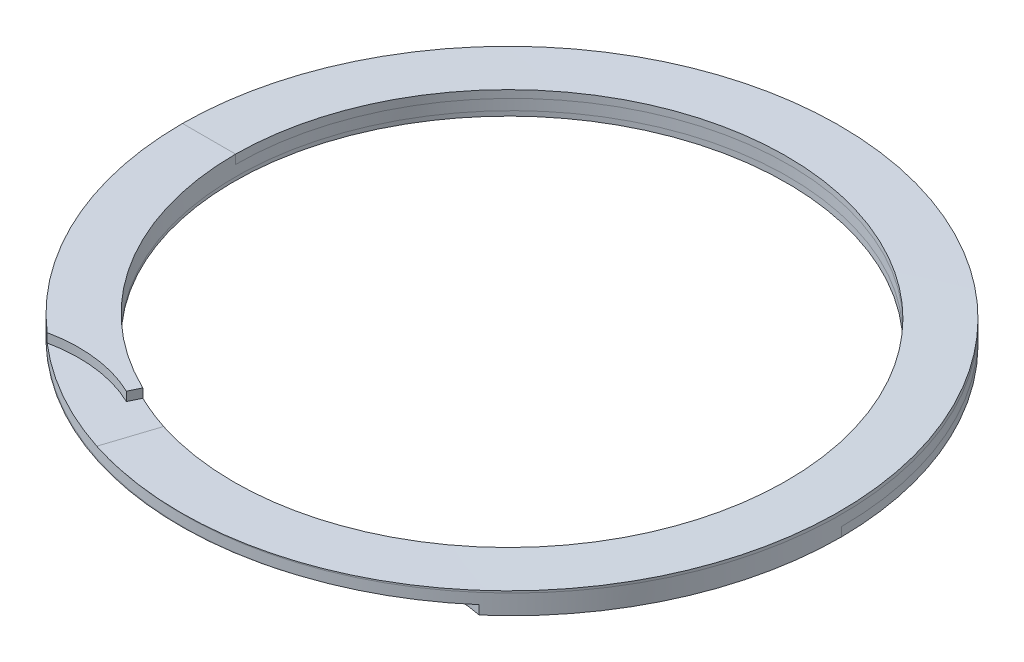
ISO-10303-21;
HEADER;
FILE_DESCRIPTION(('STEP AP214'),'2;1');
FILE_NAME('part.step','',(''),(''),'','','');
FILE_SCHEMA(('AUTOMOTIVE_DESIGN { 1 0 10303 214 1 1 1 1 }'));
ENDSEC;
DATA;
#1=APPLICATION_CONTEXT('core data for automotive mechanical design processes');
#2=APPLICATION_PROTOCOL_DEFINITION('international standard','automotive_design',2000,#1);
#3=PRODUCT_CONTEXT('',#1,'mechanical');
#4=PRODUCT('Part','Part','',(#3));
#5=PRODUCT_RELATED_PRODUCT_CATEGORY('part','',(#4));
#6=PRODUCT_DEFINITION_FORMATION('','',#4);
#7=PRODUCT_DEFINITION_CONTEXT('part definition',#1,'design');
#8=PRODUCT_DEFINITION('design','',#6,#7);
#9=PRODUCT_DEFINITION_SHAPE('','',#8);
#10=(LENGTH_UNIT() NAMED_UNIT(*) SI_UNIT(.MILLI.,.METRE.));
#11=(NAMED_UNIT(*) PLANE_ANGLE_UNIT() SI_UNIT($,.RADIAN.));
#12=(NAMED_UNIT(*) SI_UNIT($,.STERADIAN.) SOLID_ANGLE_UNIT());
#13=UNCERTAINTY_MEASURE_WITH_UNIT(LENGTH_MEASURE(1.E-05),#10,'distance_accuracy_value','');
#14=(GEOMETRIC_REPRESENTATION_CONTEXT(3) GLOBAL_UNCERTAINTY_ASSIGNED_CONTEXT((#13)) GLOBAL_UNIT_ASSIGNED_CONTEXT((#10,
#11,#12)) REPRESENTATION_CONTEXT('',''));
#15=CARTESIAN_POINT('',(0.,0.,0.));
#16=DIRECTION('',(0.,0.,1.));
#17=DIRECTION('',(1.,0.,0.));
#18=AXIS2_PLACEMENT_3D('',#15,#16,#17);
#19=CARTESIAN_POINT('',(0.,-0.889,0.));
#20=DIRECTION('',(0.,1.,0.));
#21=DIRECTION('',(0.,0.,1.));
#22=AXIS2_PLACEMENT_3D('',#19,#20,#21);
#23=CYLINDRICAL_SURFACE('',#22,8.5979);
#24=CARTESIAN_POINT('',(0.,-0.6096,0.));
#25=DIRECTION('',(0.,1.,0.));
#26=DIRECTION('',(0.,0.,-1.));
#27=AXIS2_PLACEMENT_3D('',#24,#25,#26);
#28=CIRCLE('',#27,8.5979);
#29=CARTESIAN_POINT('',(2.65868454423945,-0.6096,8.17650786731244));
#30=VERTEX_POINT('',#29);
#31=CARTESIAN_POINT('',(3.74356478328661,-0.6096,7.74012965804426));
#32=VERTEX_POINT('',#31);
#33=EDGE_CURVE('E180',#30,#32,#28,.T.);
#34=ORIENTED_EDGE('',*,*,#33,.F.);
#35=CARTESIAN_POINT('',(8.5979,-0.889,0.));
#36=CARTESIAN_POINT('',(8.5979,-0.859895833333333,-4.96399987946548));
#37=CARTESIAN_POINT('',(4.29895,-0.830791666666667,-7.44599981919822));
#38=CARTESIAN_POINT('',(0.,-0.8016875,-9.92799975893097));
#39=CARTESIAN_POINT('',(-4.29895,-0.772583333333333,-7.44599981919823));
#40=CARTESIAN_POINT('',(-8.5979,-0.743479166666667,-4.96399987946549));
#41=CARTESIAN_POINT('',(-8.5979,-0.714375,0.));
#42=CARTESIAN_POINT('',(-8.5979,-0.685270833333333,4.96399987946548));
#43=CARTESIAN_POINT('',(-4.29895,-0.656166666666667,7.44599981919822));
#44=CARTESIAN_POINT('',(-0.983778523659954,-0.633722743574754,9.36001496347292));
#45=CARTESIAN_POINT('',(2.65689495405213,-0.609075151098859,8.17708955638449));
#46=CARTESIAN_POINT('',(2.86189757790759,-0.607687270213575,8.11048022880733));
#47=CARTESIAN_POINT('',(3.06690020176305,-0.60629938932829,8.04387090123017));
#48=(BOUNDED_CURVE() B_SPLINE_CURVE(2,(#35,#36,#37,#38,#39,#40,#41,#42,#43,#44,#45,#46,#47),
.UNSPECIFIED.,.F.,.F.) B_SPLINE_CURVE_WITH_KNOTS((3,2,2,2,2,2,3),(0.,0.166666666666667,
0.333333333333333,0.5,0.666666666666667,0.79925818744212,0.807250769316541),
.UNSPECIFIED.) CURVE() GEOMETRIC_REPRESENTATION_ITEM() RATIONAL_B_SPLINE_CURVE((1.,
0.866025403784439,1.,0.866025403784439,1.,0.866025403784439,1.,0.866025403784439,1.,
0.893416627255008,0.956417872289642,0.956417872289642,0.956417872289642)) REPRESENTATION_ITEM(''));
#49=CARTESIAN_POINT('',(2.57936999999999,-0.6096,8.20187385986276));
#50=VERTEX_POINT('',#49);
#51=EDGE_CURVE('E268',#50,#30,#48,.T.);
#52=ORIENTED_EDGE('',*,*,#51,.F.);
#53=CARTESIAN_POINT('',(8.5979,-0.6096,0.));
#54=CARTESIAN_POINT('',(8.5979004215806,-0.609679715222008,-0.086075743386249));
#55=CARTESIAN_POINT('',(8.59660742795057,-0.609752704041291,-0.172151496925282));
#56=CARTESIAN_POINT('',(8.59141791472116,-0.609886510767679,-0.344881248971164));
#57=CARTESIAN_POINT('',(8.587501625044,-0.60994723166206,-0.431534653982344));
#58=CARTESIAN_POINT('',(8.57701118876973,-0.610056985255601,-0.605305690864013));
#59=CARTESIAN_POINT('',(8.57041813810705,-0.610105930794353,-0.692422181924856));
#60=CARTESIAN_POINT('',(8.55452678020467,-0.610192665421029,-0.86700063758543));
#61=CARTESIAN_POINT('',(8.5452105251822,-0.610230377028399,-0.954460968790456));
#62=CARTESIAN_POINT('',(8.52383195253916,-0.610295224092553,-1.12960401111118));
#63=CARTESIAN_POINT('',(8.5117527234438,-0.610322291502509,-1.21728465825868));
#64=CARTESIAN_POINT('',(8.48481463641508,-0.610366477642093,-1.3927413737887));
#65=CARTESIAN_POINT('',(8.46993997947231,-0.610383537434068,-1.48051501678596));
#66=CARTESIAN_POINT('',(8.43738504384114,-0.610408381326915,-1.6560274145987));
#67=CARTESIAN_POINT('',(8.41969014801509,-0.610416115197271,-1.74376345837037));
#68=CARTESIAN_POINT('',(8.38147667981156,-0.610423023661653,-1.91906755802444));
#69=CARTESIAN_POINT('',(8.36094473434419,-0.610422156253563,-2.00663269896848));
#70=CARTESIAN_POINT('',(8.31704734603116,-0.610412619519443,-2.1814597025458));
#71=CARTESIAN_POINT('',(8.29366982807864,-0.61040391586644,-2.26871853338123));
#72=CARTESIAN_POINT('',(8.24407995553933,-0.610379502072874,-2.44279607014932));
#73=CARTESIAN_POINT('',(8.21785686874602,-0.610363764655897,-2.52961171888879));
#74=CARTESIAN_POINT('',(8.1625831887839,-0.610326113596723,-2.70266515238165));
#75=CARTESIAN_POINT('',(8.13352324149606,-0.610304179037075,-2.78889994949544));
#76=CARTESIAN_POINT('',(8.07259196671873,-0.610254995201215,-2.96065373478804));
#77=CARTESIAN_POINT('',(8.04071268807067,-0.610227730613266,-3.0461699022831));
#78=CARTESIAN_POINT('',(7.9741677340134,-0.610168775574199,-3.21634898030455));
#79=CARTESIAN_POINT('',(7.93949552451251,-0.610137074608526,-3.30100933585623));
#80=CARTESIAN_POINT('',(7.86739854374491,-0.610070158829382,-3.46934055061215));
#81=CARTESIAN_POINT('',(7.82996865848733,-0.610034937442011,-3.55300921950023));
#82=CARTESIAN_POINT('',(7.75239893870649,-0.609961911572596,-3.7192227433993));
#83=CARTESIAN_POINT('',(7.71225540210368,-0.609924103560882,-3.80176587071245));
#84=CARTESIAN_POINT('',(7.62930962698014,-0.609846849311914,-3.96559662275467));
#85=CARTESIAN_POINT('',(7.58650507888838,-0.609807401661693,-4.04688307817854));
#86=CARTESIAN_POINT('',(7.49829695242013,-0.609727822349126,-4.20807211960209));
#87=CARTESIAN_POINT('',(7.45289242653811,-0.609687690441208,-4.28797418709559));
#88=CARTESIAN_POINT('',(7.35955216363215,-0.609607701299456,-4.44627007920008));
#89=CARTESIAN_POINT('',(7.31161680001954,-0.609567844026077,-4.5246641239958));
#90=CARTESIAN_POINT('',(7.21329048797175,-0.609489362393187,-4.67982423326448));
#91=CARTESIAN_POINT('',(7.16290118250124,-0.60945073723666,-4.75659133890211));
#92=CARTESIAN_POINT('',(7.059750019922,-0.609375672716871,-4.90838307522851));
#93=CARTESIAN_POINT('',(7.00699101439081,-0.609339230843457,-4.98340964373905));
#94=CARTESIAN_POINT('',(6.89919043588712,-0.609269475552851,-5.13161161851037));
#95=CARTESIAN_POINT('',(6.84415285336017,-0.609236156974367,-5.20478992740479));
#96=CARTESIAN_POINT('',(6.7318915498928,-0.609173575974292,-5.34919301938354));
#97=CARTESIAN_POINT('',(6.67467288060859,-0.60914430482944,-5.42042172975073));
#98=CARTESIAN_POINT('',(6.55815172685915,-0.609090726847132,-5.56083004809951));
#99=CARTESIAN_POINT('',(6.49885527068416,-0.609066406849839,-5.63001465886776));
#100=CARTESIAN_POINT('',(6.37828617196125,-0.609023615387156,-5.7662463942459));
#101=CARTESIAN_POINT('',(6.31702044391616,-0.609005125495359,-5.83329963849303));
#102=CARTESIAN_POINT('',(6.1926251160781,-0.608974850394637,-5.96518779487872));
#103=CARTESIAN_POINT('',(6.12950322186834,-0.608963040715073,-6.0300299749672));
#104=CARTESIAN_POINT('',(6.00151191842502,-0.608946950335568,-6.15742297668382));
#105=CARTESIAN_POINT('',(5.93665090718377,-0.608942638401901,-6.21998223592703));
#106=CARTESIAN_POINT('',(5.80530110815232,-0.608942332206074,-6.34274440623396));
#107=CARTESIAN_POINT('',(5.73882130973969,-0.608946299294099,-6.40295693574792));
#108=CARTESIAN_POINT('',(5.60435638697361,-0.608963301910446,-6.52096884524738));
#109=CARTESIAN_POINT('',(5.53638074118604,-0.608976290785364,-6.57877902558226));
#110=CARTESIAN_POINT('',(5.39904861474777,-0.609012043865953,-6.69193771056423));
#111=CARTESIAN_POINT('',(5.32970199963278,-0.609034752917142,-6.74729818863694));
#112=CARTESIAN_POINT('',(5.18975379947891,-0.60909061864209,-6.85551724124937));
#113=CARTESIAN_POINT('',(5.11916236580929,-0.609123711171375,-6.90838894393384));
#114=CARTESIAN_POINT('',(4.97685111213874,-0.609200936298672,-7.01159847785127));
#115=CARTESIAN_POINT('',(4.90514163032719,-0.609244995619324,-7.06195056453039));
#116=CARTESIAN_POINT('',(4.76072094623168,-0.60934482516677,-7.16009706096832));
#117=CARTESIAN_POINT('',(4.68802017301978,-0.609400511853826,-7.20790681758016));
#118=CARTESIAN_POINT('',(4.54174303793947,-0.609523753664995,-7.30095285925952));
#119=CARTESIAN_POINT('',(4.46817710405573,-0.609591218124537,-7.3462055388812));
#120=CARTESIAN_POINT('',(4.32010097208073,-0.609740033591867,-7.43424459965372));
#121=CARTESIAN_POINT('',(4.24559766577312,-0.609821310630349,-7.47704257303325));
#122=CARTESIAN_POINT('',(4.09486595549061,-0.609967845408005,-7.56065021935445));
#123=CARTESIAN_POINT('',(4.01862961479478,-0.610032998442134,-7.6014455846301));
#124=CARTESIAN_POINT('',(3.86439444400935,-0.610152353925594,-7.68101068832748));
#125=CARTESIAN_POINT('',(3.78638676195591,-0.610206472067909,-7.71976326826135));
#126=CARTESIAN_POINT('',(3.62868489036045,-0.610303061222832,-7.79514086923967));
#127=CARTESIAN_POINT('',(3.54898275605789,-0.610345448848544,-7.8317492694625));
#128=CARTESIAN_POINT('',(3.38797516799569,-0.610419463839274,-7.90274000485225));
#129=CARTESIAN_POINT('',(3.30666266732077,-0.610451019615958,-7.93710635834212));
#130=CARTESIAN_POINT('',(3.14252456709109,-0.610503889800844,-8.00351853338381));
#131=CARTESIAN_POINT('',(3.05969280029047,-0.610525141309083,-8.03554911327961));
#132=CARTESIAN_POINT('',(2.89261319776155,-0.610558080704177,-8.09719991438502));
#133=CARTESIAN_POINT('',(2.80836004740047,-0.610569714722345,-8.12680573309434));
#134=CARTESIAN_POINT('',(2.63854123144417,-0.610584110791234,-8.18352241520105));
#135=CARTESIAN_POINT('',(2.55297106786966,-0.610586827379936,-8.2106198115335));
#136=CARTESIAN_POINT('',(2.38062795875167,-0.61058413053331,-8.26224085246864));
#137=CARTESIAN_POINT('',(2.29385128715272,-0.610578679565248,-8.28675205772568));
#138=CARTESIAN_POINT('',(2.11921067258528,-0.610560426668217,-8.33312826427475));
#139=CARTESIAN_POINT('',(2.03134372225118,-0.610547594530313,-8.35498194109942));
#140=CARTESIAN_POINT('',(1.8546433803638,-0.610515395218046,-8.39597749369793));
#141=CARTESIAN_POINT('',(1.76580763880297,-0.610496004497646,-8.41510924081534));
#142=CARTESIAN_POINT('',(1.58729535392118,-0.610451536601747,-8.45060266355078));
#143=CARTESIAN_POINT('',(1.49761704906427,-0.61042644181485,-8.46695547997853));
#144=CARTESIAN_POINT('',(1.31754952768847,-0.610371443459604,-8.49684052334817));
#145=CARTESIAN_POINT('',(1.22715906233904,-0.610341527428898,-8.5103652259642));
#146=CARTESIAN_POINT('',(1.04580075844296,-0.610277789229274,-8.53455165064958));
#147=CARTESIAN_POINT('',(0.954832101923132,-0.610243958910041,-8.54520723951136));
#148=CARTESIAN_POINT('',(0.772453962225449,-0.610173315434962,-8.5636214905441));
#149=CARTESIAN_POINT('',(0.681044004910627,-0.610136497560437,-8.57137545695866));
#150=CARTESIAN_POINT('',(0.497922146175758,-0.610060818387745,-8.58396121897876));
#151=CARTESIAN_POINT('',(0.406210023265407,-0.610021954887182,-8.58878979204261));
#152=CARTESIAN_POINT('',(0.22262435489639,-0.6099431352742,-8.59550841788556));
#153=CARTESIAN_POINT('',(0.130750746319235,-0.609903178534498,-8.59739674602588));
#154=CARTESIAN_POINT('',(-0.0530164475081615,-0.609823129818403,-8.59822755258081));
#155=CARTESIAN_POINT('',(-0.144910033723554,-0.609783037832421,-8.5971698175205));
#156=CARTESIAN_POINT('',(-0.328575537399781,-0.609703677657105,-8.59211024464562));
#157=CARTESIAN_POINT('',(-0.420347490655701,-0.609664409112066,-8.58810970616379));
#158=CARTESIAN_POINT('',(-0.603628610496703,-0.609587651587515,-8.5771753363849));
#159=CARTESIAN_POINT('',(-0.695137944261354,-0.609550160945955,-8.57024430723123));
#160=CARTESIAN_POINT('',(-0.877753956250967,-0.609477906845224,-8.55346874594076));
#161=CARTESIAN_POINT('',(-0.968861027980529,-0.609443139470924,-8.54362849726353));
#162=CARTESIAN_POINT('',(-1.15053460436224,-0.609377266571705,-8.52106311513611));
#163=CARTESIAN_POINT('',(-1.24110182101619,-0.609346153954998,-8.50834371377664));
#164=CARTESIAN_POINT('',(-1.42156042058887,-0.609288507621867,-8.48005725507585));
#165=CARTESIAN_POINT('',(-1.51145292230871,-0.609261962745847,-8.46449733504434));
#166=CARTESIAN_POINT('',(-1.69043012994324,-0.609214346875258,-8.43057539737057));
#167=CARTESIAN_POINT('',(-1.77951644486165,-0.609193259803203,-8.41222186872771));
#168=CARTESIAN_POINT('',(-1.95675324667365,-0.609157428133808,-8.37276626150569));
#169=CARTESIAN_POINT('',(-2.04490591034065,-0.60914266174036,-8.3516739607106));
#170=CARTESIAN_POINT('',(-2.2201518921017,-0.60912030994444,-8.30680195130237));
#171=CARTESIAN_POINT('',(-2.30724802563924,-0.609112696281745,-8.28303323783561));
#172=CARTESIAN_POINT('',(-2.48026248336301,-0.609105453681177,-8.23287669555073));
#173=CARTESIAN_POINT('',(-2.56618432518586,-0.609105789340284,-8.20650100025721));
#174=CARTESIAN_POINT('',(-2.73673727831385,-0.609115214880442,-8.15120544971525));
#175=CARTESIAN_POINT('',(-2.82137266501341,-0.609124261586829,-8.12229878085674));
#176=CARTESIAN_POINT('',(-2.98924576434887,-0.609151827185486,-8.06202237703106));
#177=CARTESIAN_POINT('',(-3.07248855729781,-0.609170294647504,-8.03066679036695));
#178=CARTESIAN_POINT('',(-3.23747588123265,-0.609217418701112,-7.96557922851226));
#179=CARTESIAN_POINT('',(-3.31922633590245,-0.609246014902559,-7.93186226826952));
#180=CARTESIAN_POINT('',(-3.48113507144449,-0.609313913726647,-7.86214364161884));
#181=CARTESIAN_POINT('',(-3.56130014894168,-0.609353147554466,-7.82615775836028));
#182=CARTESIAN_POINT('',(-3.7199511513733,-0.60944336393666,-7.75199737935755));
#183=CARTESIAN_POINT('',(-3.79844476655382,-0.60949426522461,-7.71383933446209));
#184=CARTESIAN_POINT('',(-3.9536730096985,-0.609606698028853,-7.63543452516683));
#185=CARTESIAN_POINT('',(-4.03041623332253,-0.609668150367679,-7.59520477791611));
#186=CARTESIAN_POINT('',(-4.18208385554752,-0.609808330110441,-7.51275273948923));
#187=CARTESIAN_POINT('',(-4.25701755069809,-0.609886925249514,-7.47054754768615));
#188=CARTESIAN_POINT('',(-4.40574123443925,-0.61003825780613,-7.38381706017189));
#189=CARTESIAN_POINT('',(-4.47952848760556,-0.61011098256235,-7.33928707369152));
#190=CARTESIAN_POINT('',(-4.62628363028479,-0.610242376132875,-7.24768395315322));
#191=CARTESIAN_POINT('',(-4.69924110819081,-0.610300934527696,-7.20059413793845));
#192=CARTESIAN_POINT('',(-4.84421086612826,-0.610406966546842,-7.10388286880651));
#193=CARTESIAN_POINT('',(-4.91621270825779,-0.610454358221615,-7.05424576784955));
#194=CARTESIAN_POINT('',(-5.05914449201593,-0.61053792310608,-6.95245929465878));
#195=CARTESIAN_POINT('',(-5.13006406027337,-0.610574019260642,-6.900295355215));
#196=CARTESIAN_POINT('',(-5.27070430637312,-0.610635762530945,-6.79348262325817));
#197=CARTESIAN_POINT('',(-5.34041477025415,-0.610661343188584,-6.73882038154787));
#198=CARTESIAN_POINT('',(-5.47851015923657,-0.610702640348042,-6.62704664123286));
#199=CARTESIAN_POINT('',(-5.54688512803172,-0.610718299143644,-6.56992284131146));
#200=CARTESIAN_POINT('',(-5.68218386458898,-0.610740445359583,-6.45326983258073));
#201=CARTESIAN_POINT('',(-5.74909803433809,-0.610746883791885,-6.3937294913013));
#202=CARTESIAN_POINT('',(-5.88135115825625,-0.610751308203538,-6.2722955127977));
#203=CARTESIAN_POINT('',(-5.94668097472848,-0.61074925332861,-6.21039192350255));
#204=CARTESIAN_POINT('',(-6.0756436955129,-0.610737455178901,-6.08429177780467));
#205=CARTESIAN_POINT('',(-6.13926802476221,-0.610727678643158,-6.0200864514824));
#206=CARTESIAN_POINT('',(-6.26470106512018,-0.610701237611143,-5.88945126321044));
#207=CARTESIAN_POINT('',(-6.32650186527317,-0.610684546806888,-5.82301380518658));
#208=CARTESIAN_POINT('',(-6.44817279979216,-0.610645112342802,-5.68799070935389));
#209=CARTESIAN_POINT('',(-6.50803578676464,-0.610622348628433,-5.6193986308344));
#210=CARTESIAN_POINT('',(-6.62572036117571,-0.610571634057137,-5.4801503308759));
#211=CARTESIAN_POINT('',(-6.6835356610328,-0.610543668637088,-5.40948879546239));
#212=CARTESIAN_POINT('',(-6.79701907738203,-0.610483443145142,-5.26619299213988));
#213=CARTESIAN_POINT('',(-6.85268185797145,-0.610451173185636,-5.19355449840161));
#214=CARTESIAN_POINT('',(-6.96176001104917,-0.610383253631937,-5.04640319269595));
#215=CARTESIAN_POINT('',(-7.01517108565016,-0.610347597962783,-4.97188719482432));
#216=CARTESIAN_POINT('',(-7.11965173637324,-0.610273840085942,-4.82108586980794));
#217=CARTESIAN_POINT('',(-7.17071813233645,-0.61023573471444,-4.74479833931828));
#218=CARTESIAN_POINT('',(-7.27042200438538,-0.610158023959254,-4.59056502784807));
#219=CARTESIAN_POINT('',(-7.31905749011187,-0.610118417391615,-4.51261796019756));
#220=CARTESIAN_POINT('',(-7.41381927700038,-0.610038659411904,-4.35518220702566));
#221=CARTESIAN_POINT('',(-7.45994484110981,-0.609998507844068,-4.27569307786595));
#222=CARTESIAN_POINT('',(-7.5496141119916,-0.60991861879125,-4.11529480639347));
#223=CARTESIAN_POINT('',(-7.5931583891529,-0.609878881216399,-4.03438598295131));
#224=CARTESIAN_POINT('',(-7.67760038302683,-0.609800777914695,-3.87127427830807));
#225=CARTESIAN_POINT('',(-7.7185000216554,-0.609762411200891,-3.78907239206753));
#226=CARTESIAN_POINT('',(-7.79759632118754,-0.609688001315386,-3.62350421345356));
#227=CARTESIAN_POINT('',(-7.83579628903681,-0.609651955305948,-3.54013950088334));
#228=CARTESIAN_POINT('',(-7.9094453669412,-0.609583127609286,-3.37237833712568));
#229=CARTESIAN_POINT('',(-7.94489919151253,-0.609550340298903,-3.28798395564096));
#230=CARTESIAN_POINT('',(-8.01301682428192,-0.609488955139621,-3.11829843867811));
#231=CARTESIAN_POINT('',(-8.0456867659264,-0.60946034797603,-3.03300976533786));
#232=CARTESIAN_POINT('',(-8.10820631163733,-0.609408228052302,-2.86167225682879));
#233=CARTESIAN_POINT('',(-8.13806346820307,-0.609384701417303,-2.77562617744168));
#234=CARTESIAN_POINT('',(-8.1949360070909,-0.60934362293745,-2.60291134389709));
#235=CARTESIAN_POINT('',(-8.22196034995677,-0.609326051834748,-2.51624554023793));
#236=CARTESIAN_POINT('',(-8.27315468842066,-0.609297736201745,-2.34242893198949));
#237=CARTESIAN_POINT('',(-8.29733503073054,-0.60928696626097,-2.2552811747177));
#238=CARTESIAN_POINT('',(-8.34283757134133,-0.609273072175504,-2.08063782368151));
#239=CARTESIAN_POINT('',(-8.36417147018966,-0.609269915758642,-1.99314527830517));
#240=CARTESIAN_POINT('',(-8.40398595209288,-0.609272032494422,-1.81794832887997));
#241=CARTESIAN_POINT('',(-8.4224795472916,-0.609277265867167,-1.73024688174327));
#242=CARTESIAN_POINT('',(-8.45662666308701,-0.609296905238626,-1.55476626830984));
#243=CARTESIAN_POINT('',(-8.47229445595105,-0.609311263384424,-1.46698987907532));
#244=CARTESIAN_POINT('',(-8.50081135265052,-0.609349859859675,-1.29149106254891));
#245=CARTESIAN_POINT('',(-8.51367592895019,-0.609374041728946,-1.20377114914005));
#246=CARTESIAN_POINT('',(-8.53661560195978,-0.609432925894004,-1.02851392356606));
#247=CARTESIAN_POINT('',(-8.54670730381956,-0.609467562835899,-0.940978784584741));
#248=CARTESIAN_POINT('',(-8.56413789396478,-0.6095480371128,-0.766216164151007));
#249=CARTESIAN_POINT('',(-8.57149444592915,-0.609593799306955,-0.678990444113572));
#250=CARTESIAN_POINT('',(-8.58349845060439,-0.609696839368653,-0.50496763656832));
#251=CARTESIAN_POINT('',(-8.58816454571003,-0.609754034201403,-0.41817183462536));
#252=CARTESIAN_POINT('',(-8.59483795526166,-0.609881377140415,-0.245125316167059));
#253=CARTESIAN_POINT('',(-8.59686480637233,-0.60995142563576,-0.158875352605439));
#254=CARTESIAN_POINT('',(-8.59831917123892,-0.610101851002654,0.0133221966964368));
#255=CARTESIAN_POINT('',(-8.59775642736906,-0.610182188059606,0.0992697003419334));
#256=CARTESIAN_POINT('',(-8.59404118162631,-0.61032576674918,0.271719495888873));
#257=CARTESIAN_POINT('',(-8.59087031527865,-0.610388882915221,0.3582213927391));
#258=CARTESIAN_POINT('',(-8.58188539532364,-0.610504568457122,0.531722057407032));
#259=CARTESIAN_POINT('',(-8.57605218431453,-0.610557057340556,0.618719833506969));
#260=CARTESIAN_POINT('',(-8.56169321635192,-0.610650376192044,0.793094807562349));
#261=CARTESIAN_POINT('',(-8.55314923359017,-0.610691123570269,0.880470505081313));
#262=CARTESIAN_POINT('',(-8.5333259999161,-0.610761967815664,1.05547940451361));
#263=CARTESIAN_POINT('',(-8.52202953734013,-0.610791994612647,1.1431106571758));
#264=CARTESIAN_POINT('',(-8.49666569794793,-0.610841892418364,1.31850474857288));
#265=CARTESIAN_POINT('',(-8.48258220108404,-0.610861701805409,1.40626525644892));
#266=CARTESIAN_POINT('',(-8.45161612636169,-0.610891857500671,1.58178843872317));
#267=CARTESIAN_POINT('',(-8.4347185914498,-0.610902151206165,1.66954847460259));
#268=CARTESIAN_POINT('',(-8.39810411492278,-0.610913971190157,1.8449383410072));
#269=CARTESIAN_POINT('',(-8.37837344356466,-0.610915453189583,1.93256530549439));
#270=CARTESIAN_POINT('',(-8.33608052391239,-0.610910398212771,2.10755429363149));
#271=CARTESIAN_POINT('',(-8.31350582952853,-0.610903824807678,2.19491330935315));
#272=CARTESIAN_POINT('',(-8.265521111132,-0.61088344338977,2.36922992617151));
#273=CARTESIAN_POINT('',(-8.2400999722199,-0.61086960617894,2.45618446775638));
#274=CARTESIAN_POINT('',(-8.18642723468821,-0.610835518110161,2.62955458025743));
#275=CARTESIAN_POINT('',(-8.15816589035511,-0.610815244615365,2.71596713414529));
#276=CARTESIAN_POINT('',(-8.09882637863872,-0.61076913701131,2.88811531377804));
#277=CARTESIAN_POINT('',(-8.06773986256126,-0.610743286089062,2.97384806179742));
#278=CARTESIAN_POINT('',(-8.00277249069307,-0.610686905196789,3.14449896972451));
#279=CARTESIAN_POINT('',(-7.96888470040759,-0.610656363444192,3.22941448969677));
#280=CARTESIAN_POINT('',(-7.8983461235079,-0.610591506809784,3.39829428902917));
#281=CARTESIAN_POINT('',(-7.86168982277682,-0.610557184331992,3.48225626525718));
#282=CARTESIAN_POINT('',(-7.7856543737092,-0.610485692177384,3.64909404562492));
#283=CARTESIAN_POINT('',(-7.74627112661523,-0.610448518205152,3.73196798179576));
#284=CARTESIAN_POINT('',(-7.66483061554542,-0.610372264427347,3.89649718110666));
#285=CARTESIAN_POINT('',(-7.62277065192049,-0.610333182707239,3.9781511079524));
#286=CARTESIAN_POINT('',(-7.53603402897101,-0.610254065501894,4.14011091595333));
#287=CARTESIAN_POINT('',(-7.49135604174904,-0.610214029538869,4.22041608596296));
#288=CARTESIAN_POINT('',(-7.39944892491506,-0.610133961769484,4.37955281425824));
#289=CARTESIAN_POINT('',(-7.35221980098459,-0.610093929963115,4.45838437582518));
#290=CARTESIAN_POINT('',(-7.25528387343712,-0.610014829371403,4.61445277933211));
#291=CARTESIAN_POINT('',(-7.20557836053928,-0.609975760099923,4.69169042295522));
#292=CARTESIAN_POINT('',(-7.10377064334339,-0.609899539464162,4.84445495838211));
#293=CARTESIAN_POINT('',(-7.0516709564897,-0.609862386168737,4.91998352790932));
#294=CARTESIAN_POINT('',(-6.94516296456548,-0.60979094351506,5.06921953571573));
#295=CARTESIAN_POINT('',(-6.89075833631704,-0.609756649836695,5.14292959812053));
#296=CARTESIAN_POINT('',(-6.77973512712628,-0.609691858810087,5.28842439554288));
#297=CARTESIAN_POINT('',(-6.72312130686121,-0.609661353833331,5.36021276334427));
#298=CARTESIAN_POINT('',(-6.60778043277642,-0.609605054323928,5.50176663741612));
#299=CARTESIAN_POINT('',(-6.54905914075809,-0.60957924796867,5.57153683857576));
#300=CARTESIAN_POINT('',(-6.42960951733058,-0.609533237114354,5.70896392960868));
#301=CARTESIAN_POINT('',(-6.36888785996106,-0.609513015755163,5.77662662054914));
#302=CARTESIAN_POINT('',(-6.24554856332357,-0.609479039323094,5.90975568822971));
#303=CARTESIAN_POINT('',(-6.18293841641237,-0.609465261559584,5.97522900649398));
#304=CARTESIAN_POINT('',(-6.05593742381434,-0.609445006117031,6.10390407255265));
#305=CARTESIAN_POINT('',(-5.99155479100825,-0.609438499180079,6.16711392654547));
#306=CARTESIAN_POINT('',(-5.86112767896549,-0.609433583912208,6.29119478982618));
#307=CARTESIAN_POINT('',(-5.79509203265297,-0.609435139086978,6.35207508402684));
#308=CARTESIAN_POINT('',(-5.66148064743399,-0.609447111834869,6.47143770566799));
#309=CARTESIAN_POINT('',(-5.59391425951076,-0.609457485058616,6.52993050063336));
#310=CARTESIAN_POINT('',(-5.45736537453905,-0.609487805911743,6.64446725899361));
#311=CARTESIAN_POINT('',(-5.38839264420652,-0.609507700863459,6.70052286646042));
#312=CARTESIAN_POINT('',(-5.24915661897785,-0.609557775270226,6.81014268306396));
#313=CARTESIAN_POINT('',(-5.17890340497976,-0.60958789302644,6.8637196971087));
#314=CARTESIAN_POINT('',(-5.03723285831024,-0.60965892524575,6.96834803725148));
#315=CARTESIAN_POINT('',(-4.96582582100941,-0.609699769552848,7.01941330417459));
#316=CARTESIAN_POINT('',(-4.82197433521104,-0.609793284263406,7.11899205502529));
#317=CARTESIAN_POINT('',(-4.74954029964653,-0.609845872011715,7.16752058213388));
#318=CARTESIAN_POINT('',(-4.60376115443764,-0.609961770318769,7.26200782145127));
#319=CARTESIAN_POINT('',(-4.53042648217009,-0.610025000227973,7.30798263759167));
#320=CARTESIAN_POINT('',(-4.3829218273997,-0.610168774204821,7.39738236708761));
#321=CARTESIAN_POINT('',(-4.30876131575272,-0.610249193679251,7.44082290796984));
#322=CARTESIAN_POINT('',(-4.1588818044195,-0.610399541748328,7.52562482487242));
#323=CARTESIAN_POINT('',(-4.08315788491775,-0.610469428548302,7.56697750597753));
#324=CARTESIAN_POINT('',(-3.92992743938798,-0.610596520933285,7.64768652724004));
#325=CARTESIAN_POINT('',(-3.85241180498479,-0.610653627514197,7.68702557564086));
#326=CARTESIAN_POINT('',(-3.69567186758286,-0.610756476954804,7.7636045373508));
#327=CARTESIAN_POINT('',(-3.61643936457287,-0.610802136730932,7.80082766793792));
#328=CARTESIAN_POINT('',(-3.45634685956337,-0.610882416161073,7.8730752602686));
#329=CARTESIAN_POINT('',(-3.37547955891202,-0.610916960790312,7.9080835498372));
#330=CARTESIAN_POINT('',(-3.2122057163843,-0.610975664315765,7.9758057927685));
#331=CARTESIAN_POINT('',(-3.12979276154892,-0.610999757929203,8.00850428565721));
#332=CARTESIAN_POINT('',(-2.96352274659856,-0.611038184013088,8.07151573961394));
#333=CARTESIAN_POINT('',(-2.87966013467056,-0.611052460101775,8.101814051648));
#334=CARTESIAN_POINT('',(-2.71059255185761,-0.611071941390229,8.15993901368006));
#335=CARTESIAN_POINT('',(-2.62538285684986,-0.611077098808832,8.18775192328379));
#336=CARTESIAN_POINT('',(-2.45372913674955,-0.611079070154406,8.24082559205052));
#337=CARTESIAN_POINT('',(-2.36728117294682,-0.61107584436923,8.26607361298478));
#338=CARTESIAN_POINT('',(-2.19326484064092,-0.611061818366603,8.31394320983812));
#339=CARTESIAN_POINT('',(-2.10569326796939,-0.611050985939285,8.33655313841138));
#340=CARTESIAN_POINT('',(-1.9295490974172,-0.611022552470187,8.37907897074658));
#341=CARTESIAN_POINT('',(-1.84097397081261,-0.611004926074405,8.39898440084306));
#342=CARTESIAN_POINT('',(-1.66294703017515,-0.610963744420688,8.43604085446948));
#343=CARTESIAN_POINT('',(-1.57349329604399,-0.610940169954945,8.45318265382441));
#344=CARTESIAN_POINT('',(-1.39383789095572,-0.610887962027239,8.48465910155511));
#345=CARTESIAN_POINT('',(-1.30363483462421,-0.610859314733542,8.49898584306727));
#346=CARTESIAN_POINT('',(-1.12261335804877,-0.610797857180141,8.52478745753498));
#347=CARTESIAN_POINT('',(-1.0317940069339,-0.61076503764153,8.53625579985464));
#348=CARTESIAN_POINT('',(-0.849675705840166,-0.610696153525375,8.55630425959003));
#349=CARTESIAN_POINT('',(-0.758376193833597,-0.610660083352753,8.5648792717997));
#350=CARTESIAN_POINT('',(-0.575435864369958,-0.610585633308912,8.57911335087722));
#351=CARTESIAN_POINT('',(-0.483794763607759,-0.610547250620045,8.58476877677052));
#352=CARTESIAN_POINT('',(-0.300311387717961,-0.610469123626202,8.59314480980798));
#353=CARTESIAN_POINT('',(-0.208469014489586,-0.610429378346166,8.59586326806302));
#354=CARTESIAN_POINT('',(-0.0247243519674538,-0.610349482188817,8.5983554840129));
#355=CARTESIAN_POINT('',(0.0671779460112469,-0.610309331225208,8.59812860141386));
#356=CARTESIAN_POINT('',(0.250900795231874,-0.610229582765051,8.59472932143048));
#357=CARTESIAN_POINT('',(0.342721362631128,-0.610189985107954,8.59155779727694));
#358=CARTESIAN_POINT('',(0.526139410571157,-0.610112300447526,8.58227749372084));
#359=CARTESIAN_POINT('',(0.617737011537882,-0.610074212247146,8.57617109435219));
#360=CARTESIAN_POINT('',(0.80056883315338,-0.610000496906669,8.56103831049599));
#361=CARTESIAN_POINT('',(0.891803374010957,-0.609964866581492,8.55201579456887));
#362=CARTESIAN_POINT('',(1.07377054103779,-0.609897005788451,8.53107692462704));
#363=CARTESIAN_POINT('',(1.16450378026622,-0.609864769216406,8.51916589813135));
#364=CARTESIAN_POINT('',(1.34533226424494,-0.609804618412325,8.49248483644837));
#365=CARTESIAN_POINT('',(1.43542850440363,-0.609776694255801,8.47772154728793));
#366=CARTESIAN_POINT('',(1.61485002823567,-0.609726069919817,8.44537919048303));
#367=CARTESIAN_POINT('',(1.70417677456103,-0.609703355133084,8.42780823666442));
#368=CARTESIAN_POINT('',(1.8819301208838,-0.609664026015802,8.38990192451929));
#369=CARTESIAN_POINT('',(1.97035873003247,-0.609647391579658,8.36957598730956));
#370=CARTESIAN_POINT('',(2.14619091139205,-0.609621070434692,8.32621859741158));
#371=CARTESIAN_POINT('',(2.23359711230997,-0.60961135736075,8.30319780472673));
#372=CARTESIAN_POINT('',(2.40726469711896,-0.609599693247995,8.25451760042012));
#373=CARTESIAN_POINT('',(2.4935293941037,-0.609597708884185,8.22887000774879));
#374=CARTESIAN_POINT('',(2.57936999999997,-0.6096,8.20187385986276));
#375=B_SPLINE_CURVE_WITH_KNOTS('',3,(#53,#54,#55,#56,#57,#58,#59,#60,#61,#62,#63,#64,#65,#66,
#67,#68,#69,#70,#71,#72,#73,#74,#75,#76,#77,#78,#79,#80,#81,#82,#83,#84,#85,#86,#87,#88,#89,#90,
#91,#92,#93,#94,#95,#96,#97,#98,#99,#100,#101,#102,#103,#104,#105,#106,#107,#108,#109,#110,#111,
#112,#113,#114,#115,#116,#117,#118,#119,#120,#121,#122,#123,#124,#125,#126,#127,#128,#129,#130,
#131,#132,#133,#134,#135,#136,#137,#138,#139,#140,#141,#142,#143,#144,#145,#146,#147,#148,#149,
#150,#151,#152,#153,#154,#155,#156,#157,#158,#159,#160,#161,#162,#163,#164,#165,#166,#167,#168,
#169,#170,#171,#172,#173,#174,#175,#176,#177,#178,#179,#180,#181,#182,#183,#184,#185,#186,#187,
#188,#189,#190,#191,#192,#193,#194,#195,#196,#197,#198,#199,#200,#201,#202,#203,#204,#205,#206,
#207,#208,#209,#210,#211,#212,#213,#214,#215,#216,#217,#218,#219,#220,#221,#222,#223,#224,#225,
#226,#227,#228,#229,#230,#231,#232,#233,#234,#235,#236,#237,#238,#239,#240,#241,#242,#243,#244,
#245,#246,#247,#248,#249,#250,#251,#252,#253,#254,#255,#256,#257,#258,#259,#260,#261,#262,#263,
#264,#265,#266,#267,#268,#269,#270,#271,#272,#273,#274,#275,#276,#277,#278,#279,#280,#281,#282,
#283,#284,#285,#286,#287,#288,#289,#290,#291,#292,#293,#294,#295,#296,#297,#298,#299,#300,#301,
#302,#303,#304,#305,#306,#307,#308,#309,#310,#311,#312,#313,#314,#315,#316,#317,#318,#319,#320,
#321,#322,#323,#324,#325,#326,#327,#328,#329,#330,#331,#332,#333,#334,#335,#336,#337,#338,#339,
#340,#341,#342,#343,#344,#345,#346,#347,#348,#349,#350,#351,#352,#353,#354,#355,#356,#357,#358,
#359,#360,#361,#362,#363,#364,#365,#366,#367,#368,#369,#370,#371,#372,#373,#374),.UNSPECIFIED.,
.F.,.F.,(4,2,2,2,2,2,2,2,2,2,2,2,2,2,2,2,2,2,2,2,2,2,2,2,2,2,2,2,2,2,2,2,2,2,2,2,2,2,2,2,2,2,2,
2,2,2,2,2,2,2,2,2,2,2,2,2,2,2,2,2,2,2,2,2,2,2,2,2,2,2,2,2,2,2,2,2,2,2,2,2,2,2,2,2,2,2,2,2,2,2,2,
2,2,2,2,2,2,2,2,2,2,2,2,2,2,2,2,2,2,2,2,2,2,2,2,2,2,2,2,2,2,2,2,2,2,2,2,2,2,2,2,2,2,2,2,2,2,2,2,
2,2,2,2,2,2,2,2,2,2,2,2,2,2,2,2,2,2,2,2,2,4),(0.,0.258217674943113,0.518403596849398,
0.780459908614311,1.04428386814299,1.30976801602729,1.57680037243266,1.84526466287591,
2.11504057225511,2.38600402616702,2.65802749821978,2.93098034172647,3.20472914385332,
3.47913810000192,3.75406940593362,4.02938366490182,4.30494030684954,4.58059801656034,
4.85621516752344,5.13165025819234,5.40676234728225,5.68141148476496,5.95545913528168,
6.22876859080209,6.50120536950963,6.77263759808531,7.04293637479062,7.31197611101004,
7.57963484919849,7.84579455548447,8.11034138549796,8.37316592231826,8.63416338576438,
8.89323381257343,9.15095822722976,9.41031473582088,9.67158405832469,9.93466552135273,
10.1994536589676,10.4658383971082,10.7337052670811,11.0029356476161,11.2734070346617,
11.5449933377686,11.8175652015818,12.0909903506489,12.3651339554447,12.6398590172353,
12.9150267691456,13.1904970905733,13.4661289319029,13.7417807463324,14.0173109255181,
14.2925782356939,14.5674422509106,14.8417637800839,15.1154052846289,15.3882312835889,
15.6601087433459,15.9309074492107,16.2005003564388,16.4687639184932,16.7355783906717,
17.0008281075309,17.2644017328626,17.5261924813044,17.7860983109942,18.0440656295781,
18.3025752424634,18.5630391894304,18.8253588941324,19.0894309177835,19.355147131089,
19.622394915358,19.8910573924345,20.1610136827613,20.4321391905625,20.7043059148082,
20.9773827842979,21.2512360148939,21.5257294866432,21.800725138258,22.0760833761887,
22.3516634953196,22.6273241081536,22.9029235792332,23.1783204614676,23.4533739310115,
23.7279442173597,24.0018930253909,24.2750839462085,24.5473828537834,24.8186582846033,
25.0887817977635,25.3576283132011,25.62507642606,25.8910086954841,26.1553119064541,
26.417877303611,26.6786007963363,26.93738313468,27.1951926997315,27.45483326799,
27.7163723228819,27.9797084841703,28.2447356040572,28.5113429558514,28.7794154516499,
29.0488338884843,29.3194752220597,29.5912128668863,29.8639170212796,30.1374550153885,
30.4116916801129,30.6864897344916,30.9617101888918,31.2372127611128,31.5128563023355,
31.7884992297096,32.063999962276,32.3392173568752,32.6140111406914,32.8882423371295,
33.16177368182,33.4344700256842,33.7061987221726,33.9768299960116,34.2462372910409,
34.5142975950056,34.7808917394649,35.0459046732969,35.3092257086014,35.5707487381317,
35.8303724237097,36.0881745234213,36.3469740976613,36.6077139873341,36.8702948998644,
37.134612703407,37.4005586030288,37.6680193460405,37.9368774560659,38.207011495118,
38.4782963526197,38.7506035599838,39.0238016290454,39.297756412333,39.5723314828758,
39.8473885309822,40.1227877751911,40.3983883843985,40.6740489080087,40.9496277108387,
41.2249834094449,41.4999753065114,41.7744638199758,42.0483109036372,42.3213804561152,
42.5935387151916,42.8646546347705,43.1346002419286),.UNSPECIFIED.);
#376=CARTESIAN_POINT('',(8.5979,-0.6096,0.));
#377=VERTEX_POINT('',#376);
#378=EDGE_CURVE('E242',#377,#50,#375,.T.);
#379=ORIENTED_EDGE('',*,*,#378,.F.);
#380=DIRECTION('',(0.,-1.,0.));
#381=VECTOR('',#380,1.);
#382=CARTESIAN_POINT('',(8.5979,-0.6096,0.));
#383=LINE('',#382,#381);
#384=CARTESIAN_POINT('',(8.5979,-0.889,0.));
#385=VERTEX_POINT('',#384);
#386=EDGE_CURVE('E151',#377,#385,#383,.T.);
#387=ORIENTED_EDGE('',*,*,#386,.T.);
#388=CARTESIAN_POINT('',(0.,-0.889,0.));
#389=DIRECTION('',(0.,1.,0.));
#390=DIRECTION('',(0.,0.,1.));
#391=AXIS2_PLACEMENT_3D('',#388,#389,#390);
#392=CIRCLE('',#391,8.5979);
#393=CARTESIAN_POINT('',(3.74356478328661,-0.889,7.74012965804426));
#394=VERTEX_POINT('',#393);
#395=EDGE_CURVE('E224',#394,#385,#392,.T.);
#396=ORIENTED_EDGE('',*,*,#395,.F.);
#397=DIRECTION('',(0.,-1.,0.));
#398=VECTOR('',#397,1.);
#399=CARTESIAN_POINT('',(3.74356478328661,-0.6096,7.74012965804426));
#400=LINE('',#399,#398);
#401=EDGE_CURVE('E159',#32,#394,#400,.T.);
#402=ORIENTED_EDGE('',*,*,#401,.F.);
#403=EDGE_LOOP('',(#34,#52,#379,#387,#396,#402));
#404=FACE_BOUND('',#403,.T.);
#405=CARTESIAN_POINT('',(0.,-0.2794,0.));
#406=DIRECTION('',(0.,-1.,0.));
#407=DIRECTION('',(0.,0.,-1.));
#408=AXIS2_PLACEMENT_3D('',#405,#406,#407);
#409=CIRCLE('',#408,8.5979);
#410=CARTESIAN_POINT('',(-2.65868454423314,-0.2794,8.1765078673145));
#411=VERTEX_POINT('',#410);
#412=CARTESIAN_POINT('',(-3.74356478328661,-0.2794,7.74012965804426));
#413=VERTEX_POINT('',#412);
#414=EDGE_CURVE('E191',#411,#413,#409,.T.);
#415=ORIENTED_EDGE('',*,*,#414,.F.);
#416=CARTESIAN_POINT('',(-8.5979,0.,0.));
#417=CARTESIAN_POINT('',(-8.5979,-0.0291041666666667,-4.96399987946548));
#418=CARTESIAN_POINT('',(-4.29895,-0.0582083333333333,-7.44599981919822));
#419=CARTESIAN_POINT('',(0.,-0.0873125,-9.92799975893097));
#420=CARTESIAN_POINT('',(4.29895,-0.116416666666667,-7.44599981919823));
#421=CARTESIAN_POINT('',(8.5979,-0.145520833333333,-4.96399987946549));
#422=CARTESIAN_POINT('',(8.5979,-0.174625,0.));
#423=CARTESIAN_POINT('',(8.5979,-0.203729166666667,4.96399987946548));
#424=CARTESIAN_POINT('',(4.29895,-0.232833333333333,7.44599981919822));
#425=CARTESIAN_POINT('',(0.983778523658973,-0.255277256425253,9.36001496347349));
#426=CARTESIAN_POINT('',(-2.65689495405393,-0.279924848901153,8.17708955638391));
#427=CARTESIAN_POINT('',(-2.86189757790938,-0.281312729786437,8.1104802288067));
#428=CARTESIAN_POINT('',(-3.06690020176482,-0.282700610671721,8.04387090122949));
#429=(BOUNDED_CURVE() B_SPLINE_CURVE(2,(#416,#417,#418,#419,#420,#421,#422,#423,#424,#425,#426,
#427,#428),.UNSPECIFIED.,.F.,.F.) B_SPLINE_CURVE_WITH_KNOTS((3,2,2,2,2,2,3),(0.,
0.166666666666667,0.333333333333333,0.5,0.666666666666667,0.799258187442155,0.807250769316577),
.UNSPECIFIED.) CURVE() GEOMETRIC_REPRESENTATION_ITEM() RATIONAL_B_SPLINE_CURVE((1.,
0.866025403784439,1.,0.866025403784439,1.,0.866025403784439,1.,0.866025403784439,1.,
0.89341662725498,0.956417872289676,0.956417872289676,0.956417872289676)) REPRESENTATION_ITEM(''));
#430=CARTESIAN_POINT('',(-2.57936999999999,-0.2794,8.20187385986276));
#431=VERTEX_POINT('',#430);
#432=EDGE_CURVE('E388',#431,#411,#429,.T.);
#433=ORIENTED_EDGE('',*,*,#432,.F.);
#434=CARTESIAN_POINT('',(-8.5979,-0.2794,0.));
#435=CARTESIAN_POINT('',(-8.5979004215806,-0.279320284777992,-0.0860757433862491));
#436=CARTESIAN_POINT('',(-8.59660742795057,-0.279247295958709,-0.172151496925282));
#437=CARTESIAN_POINT('',(-8.59141791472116,-0.279113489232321,-0.344881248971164));
#438=CARTESIAN_POINT('',(-8.587501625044,-0.27905276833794,-0.431534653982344));
#439=CARTESIAN_POINT('',(-8.57701118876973,-0.278943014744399,-0.605305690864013));
#440=CARTESIAN_POINT('',(-8.57041813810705,-0.278894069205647,-0.692422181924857));
#441=CARTESIAN_POINT('',(-8.55452678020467,-0.278807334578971,-0.86700063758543));
#442=CARTESIAN_POINT('',(-8.5452105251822,-0.2787696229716,-0.954460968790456));
#443=CARTESIAN_POINT('',(-8.52383195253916,-0.278704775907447,-1.12960401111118));
#444=CARTESIAN_POINT('',(-8.5117527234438,-0.278677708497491,-1.21728465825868));
#445=CARTESIAN_POINT('',(-8.48481463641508,-0.278633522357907,-1.3927413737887));
#446=CARTESIAN_POINT('',(-8.46993997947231,-0.278616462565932,-1.48051501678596));
#447=CARTESIAN_POINT('',(-8.43738504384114,-0.278591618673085,-1.6560274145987));
#448=CARTESIAN_POINT('',(-8.41969014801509,-0.278583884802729,-1.74376345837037));
#449=CARTESIAN_POINT('',(-8.38147667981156,-0.278576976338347,-1.91906755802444));
#450=CARTESIAN_POINT('',(-8.36094473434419,-0.278577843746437,-2.00663269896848));
#451=CARTESIAN_POINT('',(-8.31704734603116,-0.278587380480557,-2.1814597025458));
#452=CARTESIAN_POINT('',(-8.29366982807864,-0.27859608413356,-2.26871853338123));
#453=CARTESIAN_POINT('',(-8.24407995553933,-0.278620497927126,-2.44279607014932));
#454=CARTESIAN_POINT('',(-8.21785686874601,-0.278636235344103,-2.52961171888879));
#455=CARTESIAN_POINT('',(-8.1625831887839,-0.278673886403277,-2.70266515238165));
#456=CARTESIAN_POINT('',(-8.13352324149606,-0.278695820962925,-2.78889994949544));
#457=CARTESIAN_POINT('',(-8.07259196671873,-0.278745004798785,-2.96065373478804));
#458=CARTESIAN_POINT('',(-8.04071268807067,-0.278772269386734,-3.0461699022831));
#459=CARTESIAN_POINT('',(-7.9741677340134,-0.278831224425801,-3.21634898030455));
#460=CARTESIAN_POINT('',(-7.93949552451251,-0.278862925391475,-3.30100933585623));
#461=CARTESIAN_POINT('',(-7.86739854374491,-0.278929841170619,-3.46934055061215));
#462=CARTESIAN_POINT('',(-7.82996865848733,-0.278965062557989,-3.55300921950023));
#463=CARTESIAN_POINT('',(-7.75239893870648,-0.279038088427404,-3.7192227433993));
#464=CARTESIAN_POINT('',(-7.71225540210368,-0.279075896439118,-3.80176587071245));
#465=CARTESIAN_POINT('',(-7.62930962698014,-0.279153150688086,-3.96559662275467));
#466=CARTESIAN_POINT('',(-7.58650507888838,-0.279192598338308,-4.04688307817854));
#467=CARTESIAN_POINT('',(-7.49829695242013,-0.279272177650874,-4.20807211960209));
#468=CARTESIAN_POINT('',(-7.45289242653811,-0.279312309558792,-4.28797418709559));
#469=CARTESIAN_POINT('',(-7.35955216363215,-0.279392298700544,-4.44627007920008));
#470=CARTESIAN_POINT('',(-7.31161680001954,-0.279432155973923,-4.5246641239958));
#471=CARTESIAN_POINT('',(-7.21329048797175,-0.279510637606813,-4.67982423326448));
#472=CARTESIAN_POINT('',(-7.16290118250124,-0.27954926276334,-4.75659133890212));
#473=CARTESIAN_POINT('',(-7.059750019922,-0.279624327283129,-4.90838307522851));
#474=CARTESIAN_POINT('',(-7.00699101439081,-0.279660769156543,-4.98340964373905));
#475=CARTESIAN_POINT('',(-6.89919043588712,-0.27973052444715,-5.13161161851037));
#476=CARTESIAN_POINT('',(-6.84415285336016,-0.279763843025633,-5.20478992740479));
#477=CARTESIAN_POINT('',(-6.7318915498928,-0.279826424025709,-5.34919301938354));
#478=CARTESIAN_POINT('',(-6.67467288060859,-0.27985569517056,-5.42042172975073));
#479=CARTESIAN_POINT('',(-6.55815172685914,-0.279909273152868,-5.56083004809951));
#480=CARTESIAN_POINT('',(-6.49885527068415,-0.279933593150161,-5.63001465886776));
#481=CARTESIAN_POINT('',(-6.37828617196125,-0.279976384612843,-5.7662463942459));
#482=CARTESIAN_POINT('',(-6.31702044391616,-0.279994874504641,-5.83329963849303));
#483=CARTESIAN_POINT('',(-6.1926251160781,-0.280025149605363,-5.96518779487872));
#484=CARTESIAN_POINT('',(-6.12950322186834,-0.280036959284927,-6.0300299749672));
#485=CARTESIAN_POINT('',(-6.00151191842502,-0.280053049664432,-6.15742297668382));
#486=CARTESIAN_POINT('',(-5.93665090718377,-0.280057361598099,-6.21998223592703));
#487=CARTESIAN_POINT('',(-5.80530110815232,-0.280057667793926,-6.34274440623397));
#488=CARTESIAN_POINT('',(-5.73882130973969,-0.280053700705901,-6.40295693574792));
#489=CARTESIAN_POINT('',(-5.60435638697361,-0.280036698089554,-6.52096884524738));
#490=CARTESIAN_POINT('',(-5.53638074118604,-0.280023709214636,-6.57877902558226));
#491=CARTESIAN_POINT('',(-5.39904861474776,-0.279987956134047,-6.69193771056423));
#492=CARTESIAN_POINT('',(-5.32970199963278,-0.279965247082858,-6.74729818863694));
#493=CARTESIAN_POINT('',(-5.18975379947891,-0.27990938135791,-6.85551724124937));
#494=CARTESIAN_POINT('',(-5.11916236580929,-0.279876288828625,-6.90838894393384));
#495=CARTESIAN_POINT('',(-4.97685111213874,-0.279799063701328,-7.01159847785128));
#496=CARTESIAN_POINT('',(-4.90514163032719,-0.279755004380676,-7.06195056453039));
#497=CARTESIAN_POINT('',(-4.76072094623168,-0.279655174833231,-7.16009706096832));
#498=CARTESIAN_POINT('',(-4.68802017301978,-0.279599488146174,-7.20790681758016));
#499=CARTESIAN_POINT('',(-4.54174303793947,-0.279476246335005,-7.30095285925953));
#500=CARTESIAN_POINT('',(-4.46817710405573,-0.279408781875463,-7.3462055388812));
#501=CARTESIAN_POINT('',(-4.32010097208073,-0.279259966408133,-7.43424459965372));
#502=CARTESIAN_POINT('',(-4.24559766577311,-0.279178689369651,-7.47704257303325));
#503=CARTESIAN_POINT('',(-4.09486595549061,-0.279032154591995,-7.56065021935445));
#504=CARTESIAN_POINT('',(-4.01862961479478,-0.278967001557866,-7.6014455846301));
#505=CARTESIAN_POINT('',(-3.86439444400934,-0.278847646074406,-7.68101068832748));
#506=CARTESIAN_POINT('',(-3.78638676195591,-0.278793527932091,-7.71976326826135));
#507=CARTESIAN_POINT('',(-3.62868489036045,-0.278696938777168,-7.79514086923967));
#508=CARTESIAN_POINT('',(-3.54898275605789,-0.278654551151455,-7.8317492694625));
#509=CARTESIAN_POINT('',(-3.38797516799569,-0.278580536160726,-7.90274000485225));
#510=CARTESIAN_POINT('',(-3.30666266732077,-0.278548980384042,-7.93710635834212));
#511=CARTESIAN_POINT('',(-3.14252456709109,-0.278496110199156,-8.00351853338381));
#512=CARTESIAN_POINT('',(-3.05969280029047,-0.278474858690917,-8.03554911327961));
#513=CARTESIAN_POINT('',(-2.89261319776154,-0.278441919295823,-8.09719991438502));
#514=CARTESIAN_POINT('',(-2.80836004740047,-0.278430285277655,-8.12680573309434));
#515=CARTESIAN_POINT('',(-2.63854123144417,-0.278415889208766,-8.18352241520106));
#516=CARTESIAN_POINT('',(-2.55297106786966,-0.278413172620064,-8.2106198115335));
#517=CARTESIAN_POINT('',(-2.38062795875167,-0.27841586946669,-8.26224085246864));
#518=CARTESIAN_POINT('',(-2.29385128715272,-0.278421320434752,-8.28675205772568));
#519=CARTESIAN_POINT('',(-2.11921067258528,-0.278439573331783,-8.33312826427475));
#520=CARTESIAN_POINT('',(-2.03134372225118,-0.278452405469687,-8.35498194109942));
#521=CARTESIAN_POINT('',(-1.85464338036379,-0.278484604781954,-8.39597749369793));
#522=CARTESIAN_POINT('',(-1.76580763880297,-0.278503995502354,-8.41510924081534));
#523=CARTESIAN_POINT('',(-1.58729535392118,-0.278548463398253,-8.45060266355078));
#524=CARTESIAN_POINT('',(-1.49761704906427,-0.27857355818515,-8.46695547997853));
#525=CARTESIAN_POINT('',(-1.31754952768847,-0.278628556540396,-8.49684052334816));
#526=CARTESIAN_POINT('',(-1.22715906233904,-0.278658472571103,-8.5103652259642));
#527=CARTESIAN_POINT('',(-1.04580075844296,-0.278722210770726,-8.53455165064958));
#528=CARTESIAN_POINT('',(-0.954832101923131,-0.278756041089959,-8.54520723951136));
#529=CARTESIAN_POINT('',(-0.772453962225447,-0.278826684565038,-8.5636214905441));
#530=CARTESIAN_POINT('',(-0.681044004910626,-0.278863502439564,-8.57137545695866));
#531=CARTESIAN_POINT('',(-0.497922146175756,-0.278939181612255,-8.58396121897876));
#532=CARTESIAN_POINT('',(-0.406210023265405,-0.278978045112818,-8.5887897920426));
#533=CARTESIAN_POINT('',(-0.222624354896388,-0.2790568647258,-8.59550841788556));
#534=CARTESIAN_POINT('',(-0.130750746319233,-0.279096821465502,-8.59739674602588));
#535=CARTESIAN_POINT('',(0.0530164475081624,-0.279176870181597,-8.59822755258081));
#536=CARTESIAN_POINT('',(0.144910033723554,-0.279216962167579,-8.5971698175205));
#537=CARTESIAN_POINT('',(0.328575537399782,-0.279296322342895,-8.59211024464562));
#538=CARTESIAN_POINT('',(0.420347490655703,-0.279335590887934,-8.58810970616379));
#539=CARTESIAN_POINT('',(0.603628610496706,-0.279412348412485,-8.5771753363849));
#540=CARTESIAN_POINT('',(0.695137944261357,-0.279449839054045,-8.57024430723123));
#541=CARTESIAN_POINT('',(0.87775395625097,-0.279522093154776,-8.55346874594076));
#542=CARTESIAN_POINT('',(0.968861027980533,-0.279556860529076,-8.54362849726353));
#543=CARTESIAN_POINT('',(1.15053460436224,-0.279622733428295,-8.52106311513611));
#544=CARTESIAN_POINT('',(1.24110182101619,-0.279653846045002,-8.50834371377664));
#545=CARTESIAN_POINT('',(1.42156042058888,-0.279711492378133,-8.48005725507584));
#546=CARTESIAN_POINT('',(1.51145292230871,-0.279738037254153,-8.46449733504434));
#547=CARTESIAN_POINT('',(1.69043012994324,-0.279785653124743,-8.43057539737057));
#548=CARTESIAN_POINT('',(1.77951644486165,-0.279806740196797,-8.41222186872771));
#549=CARTESIAN_POINT('',(1.95675324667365,-0.279842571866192,-8.37276626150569));
#550=CARTESIAN_POINT('',(2.04490591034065,-0.27985733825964,-8.3516739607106));
#551=CARTESIAN_POINT('',(2.2201518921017,-0.27987969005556,-8.30680195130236));
#552=CARTESIAN_POINT('',(2.30724802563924,-0.279887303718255,-8.28303323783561));
#553=CARTESIAN_POINT('',(2.48026248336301,-0.279894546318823,-8.23287669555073));
#554=CARTESIAN_POINT('',(2.56618432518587,-0.279894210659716,-8.20650100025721));
#555=CARTESIAN_POINT('',(2.73673727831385,-0.279884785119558,-8.15120544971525));
#556=CARTESIAN_POINT('',(2.82137266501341,-0.279875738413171,-8.12229878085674));
#557=CARTESIAN_POINT('',(2.98924576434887,-0.279848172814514,-8.06202237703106));
#558=CARTESIAN_POINT('',(3.07248855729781,-0.279829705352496,-8.03066679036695));
#559=CARTESIAN_POINT('',(3.23747588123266,-0.279782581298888,-7.96557922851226));
#560=CARTESIAN_POINT('',(3.31922633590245,-0.279753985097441,-7.93186226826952));
#561=CARTESIAN_POINT('',(3.48113507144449,-0.279686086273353,-7.86214364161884));
#562=CARTESIAN_POINT('',(3.56130014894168,-0.279646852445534,-7.82615775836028));
#563=CARTESIAN_POINT('',(3.71995115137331,-0.27955663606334,-7.75199737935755));
#564=CARTESIAN_POINT('',(3.79844476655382,-0.27950573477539,-7.71383933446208));
#565=CARTESIAN_POINT('',(3.9536730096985,-0.279393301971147,-7.63543452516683));
#566=CARTESIAN_POINT('',(4.03041623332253,-0.279331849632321,-7.59520477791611));
#567=CARTESIAN_POINT('',(4.18208385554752,-0.279191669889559,-7.51275273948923));
#568=CARTESIAN_POINT('',(4.25701755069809,-0.279113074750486,-7.47054754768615));
#569=CARTESIAN_POINT('',(4.40574123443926,-0.27896174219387,-7.38381706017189));
#570=CARTESIAN_POINT('',(4.47952848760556,-0.27888901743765,-7.33928707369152));
#571=CARTESIAN_POINT('',(4.62628363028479,-0.278757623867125,-7.24768395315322));
#572=CARTESIAN_POINT('',(4.69924110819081,-0.278699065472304,-7.20059413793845));
#573=CARTESIAN_POINT('',(4.84421086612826,-0.278593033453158,-7.1038828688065));
#574=CARTESIAN_POINT('',(4.91621270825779,-0.278545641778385,-7.05424576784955));
#575=CARTESIAN_POINT('',(5.05914449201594,-0.27846207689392,-6.95245929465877));
#576=CARTESIAN_POINT('',(5.13006406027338,-0.278425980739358,-6.90029535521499));
#577=CARTESIAN_POINT('',(5.27070430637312,-0.278364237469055,-6.79348262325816));
#578=CARTESIAN_POINT('',(5.34041477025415,-0.278338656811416,-6.73882038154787));
#579=CARTESIAN_POINT('',(5.47851015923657,-0.278297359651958,-6.62704664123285));
#580=CARTESIAN_POINT('',(5.54688512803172,-0.278281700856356,-6.56992284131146));
#581=CARTESIAN_POINT('',(5.68218386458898,-0.278259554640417,-6.45326983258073));
#582=CARTESIAN_POINT('',(5.74909803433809,-0.278253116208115,-6.3937294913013));
#583=CARTESIAN_POINT('',(5.88135115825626,-0.278248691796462,-6.2722955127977));
#584=CARTESIAN_POINT('',(5.94668097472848,-0.27825074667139,-6.21039192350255));
#585=CARTESIAN_POINT('',(6.0756436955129,-0.278262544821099,-6.08429177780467));
#586=CARTESIAN_POINT('',(6.13926802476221,-0.278272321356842,-6.0200864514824));
#587=CARTESIAN_POINT('',(6.26470106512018,-0.278298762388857,-5.88945126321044));
#588=CARTESIAN_POINT('',(6.32650186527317,-0.278315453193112,-5.82301380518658));
#589=CARTESIAN_POINT('',(6.44817279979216,-0.278354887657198,-5.68799070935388));
#590=CARTESIAN_POINT('',(6.50803578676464,-0.278377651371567,-5.6193986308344));
#591=CARTESIAN_POINT('',(6.62572036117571,-0.278428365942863,-5.4801503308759));
#592=CARTESIAN_POINT('',(6.68353566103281,-0.278456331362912,-5.40948879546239));
#593=CARTESIAN_POINT('',(6.79701907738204,-0.278516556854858,-5.26619299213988));
#594=CARTESIAN_POINT('',(6.85268185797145,-0.278548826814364,-5.19355449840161));
#595=CARTESIAN_POINT('',(6.96176001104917,-0.278616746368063,-5.04640319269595));
#596=CARTESIAN_POINT('',(7.01517108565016,-0.278652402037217,-4.97188719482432));
#597=CARTESIAN_POINT('',(7.11965173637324,-0.278726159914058,-4.82108586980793));
#598=CARTESIAN_POINT('',(7.17071813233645,-0.27876426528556,-4.74479833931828));
#599=CARTESIAN_POINT('',(7.27042200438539,-0.278841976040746,-4.59056502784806));
#600=CARTESIAN_POINT('',(7.31905749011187,-0.278881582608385,-4.51261796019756));
#601=CARTESIAN_POINT('',(7.41381927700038,-0.278961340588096,-4.35518220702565));
#602=CARTESIAN_POINT('',(7.45994484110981,-0.279001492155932,-4.27569307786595));
#603=CARTESIAN_POINT('',(7.5496141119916,-0.27908138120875,-4.11529480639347));
#604=CARTESIAN_POINT('',(7.5931583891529,-0.279121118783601,-4.03438598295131));
#605=CARTESIAN_POINT('',(7.67760038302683,-0.279199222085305,-3.87127427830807));
#606=CARTESIAN_POINT('',(7.7185000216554,-0.279237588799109,-3.78907239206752));
#607=CARTESIAN_POINT('',(7.79759632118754,-0.279311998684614,-3.62350421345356));
#608=CARTESIAN_POINT('',(7.83579628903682,-0.279348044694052,-3.54013950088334));
#609=CARTESIAN_POINT('',(7.90944536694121,-0.279416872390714,-3.37237833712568));
#610=CARTESIAN_POINT('',(7.94489919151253,-0.279449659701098,-3.28798395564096));
#611=CARTESIAN_POINT('',(8.01301682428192,-0.279511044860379,-3.11829843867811));
#612=CARTESIAN_POINT('',(8.0456867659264,-0.279539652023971,-3.03300976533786));
#613=CARTESIAN_POINT('',(8.10820631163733,-0.279591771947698,-2.86167225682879));
#614=CARTESIAN_POINT('',(8.13806346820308,-0.279615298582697,-2.77562617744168));
#615=CARTESIAN_POINT('',(8.19493600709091,-0.27965637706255,-2.60291134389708));
#616=CARTESIAN_POINT('',(8.22196034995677,-0.279673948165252,-2.51624554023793));
#617=CARTESIAN_POINT('',(8.27315468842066,-0.279702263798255,-2.34242893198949));
#618=CARTESIAN_POINT('',(8.29733503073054,-0.27971303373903,-2.2552811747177));
#619=CARTESIAN_POINT('',(8.34283757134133,-0.279726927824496,-2.08063782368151));
#620=CARTESIAN_POINT('',(8.36417147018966,-0.279730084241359,-1.99314527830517));
#621=CARTESIAN_POINT('',(8.40398595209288,-0.279727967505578,-1.81794832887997));
#622=CARTESIAN_POINT('',(8.4224795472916,-0.279722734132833,-1.73024688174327));
#623=CARTESIAN_POINT('',(8.45662666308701,-0.279703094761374,-1.55476626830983));
#624=CARTESIAN_POINT('',(8.47229445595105,-0.279688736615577,-1.46698987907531));
#625=CARTESIAN_POINT('',(8.50081135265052,-0.279650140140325,-1.2914910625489));
#626=CARTESIAN_POINT('',(8.51367592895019,-0.279625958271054,-1.20377114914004));
#627=CARTESIAN_POINT('',(8.53661560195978,-0.279567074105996,-1.02851392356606));
#628=CARTESIAN_POINT('',(8.54670730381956,-0.279532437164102,-0.940978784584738));
#629=CARTESIAN_POINT('',(8.56413789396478,-0.2794519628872,-0.766216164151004));
#630=CARTESIAN_POINT('',(8.57149444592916,-0.279406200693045,-0.678990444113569));
#631=CARTESIAN_POINT('',(8.58349845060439,-0.279303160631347,-0.504967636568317));
#632=CARTESIAN_POINT('',(8.58816454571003,-0.279245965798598,-0.418171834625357));
#633=CARTESIAN_POINT('',(8.59483795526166,-0.279118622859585,-0.245125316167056));
#634=CARTESIAN_POINT('',(8.59686480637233,-0.279048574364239,-0.158875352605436));
#635=CARTESIAN_POINT('',(8.59831917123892,-0.278898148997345,0.0133221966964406));
#636=CARTESIAN_POINT('',(8.59775642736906,-0.278817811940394,0.0992697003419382));
#637=CARTESIAN_POINT('',(8.5940411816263,-0.27867423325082,0.271719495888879));
#638=CARTESIAN_POINT('',(8.59087031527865,-0.27861111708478,0.358221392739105));
#639=CARTESIAN_POINT('',(8.58188539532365,-0.278495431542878,0.531722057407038));
#640=CARTESIAN_POINT('',(8.57605218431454,-0.278442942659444,0.618719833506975));
#641=CARTESIAN_POINT('',(8.56169321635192,-0.278349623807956,0.793094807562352));
#642=CARTESIAN_POINT('',(8.55314923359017,-0.278308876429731,0.880470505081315));
#643=CARTESIAN_POINT('',(8.5333259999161,-0.278238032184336,1.05547940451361));
#644=CARTESIAN_POINT('',(8.52202953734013,-0.278208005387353,1.1431106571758));
#645=CARTESIAN_POINT('',(8.49666569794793,-0.278158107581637,1.31850474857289));
#646=CARTESIAN_POINT('',(8.48258220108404,-0.278138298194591,1.40626525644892));
#647=CARTESIAN_POINT('',(8.45161612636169,-0.278108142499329,1.58178843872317));
#648=CARTESIAN_POINT('',(8.4347185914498,-0.278097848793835,1.6695484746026));
#649=CARTESIAN_POINT('',(8.39810411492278,-0.278086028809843,1.8449383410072));
#650=CARTESIAN_POINT('',(8.37837344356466,-0.278084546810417,1.93256530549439));
#651=CARTESIAN_POINT('',(8.33608052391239,-0.278089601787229,2.10755429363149));
#652=CARTESIAN_POINT('',(8.31350582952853,-0.278096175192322,2.19491330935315));
#653=CARTESIAN_POINT('',(8.265521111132,-0.27811655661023,2.36922992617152));
#654=CARTESIAN_POINT('',(8.2400999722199,-0.27813039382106,2.45618446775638));
#655=CARTESIAN_POINT('',(8.18642723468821,-0.278164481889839,2.62955458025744));
#656=CARTESIAN_POINT('',(8.15816589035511,-0.278184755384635,2.7159671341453));
#657=CARTESIAN_POINT('',(8.09882637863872,-0.278230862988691,2.88811531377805));
#658=CARTESIAN_POINT('',(8.06773986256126,-0.278256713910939,2.97384806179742));
#659=CARTESIAN_POINT('',(8.00277249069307,-0.278313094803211,3.14449896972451));
#660=CARTESIAN_POINT('',(7.96888470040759,-0.278343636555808,3.22941448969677));
#661=CARTESIAN_POINT('',(7.8983461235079,-0.278408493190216,3.39829428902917));
#662=CARTESIAN_POINT('',(7.86168982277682,-0.278442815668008,3.48225626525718));
#663=CARTESIAN_POINT('',(7.7856543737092,-0.278514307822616,3.64909404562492));
#664=CARTESIAN_POINT('',(7.74627112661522,-0.278551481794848,3.73196798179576));
#665=CARTESIAN_POINT('',(7.66483061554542,-0.278627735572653,3.89649718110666));
#666=CARTESIAN_POINT('',(7.62277065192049,-0.278666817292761,3.9781511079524));
#667=CARTESIAN_POINT('',(7.53603402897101,-0.278745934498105,4.14011091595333));
#668=CARTESIAN_POINT('',(7.49135604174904,-0.278785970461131,4.22041608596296));
#669=CARTESIAN_POINT('',(7.39944892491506,-0.278866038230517,4.37955281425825));
#670=CARTESIAN_POINT('',(7.35221980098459,-0.278906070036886,4.45838437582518));
#671=CARTESIAN_POINT('',(7.25528387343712,-0.278985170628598,4.61445277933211));
#672=CARTESIAN_POINT('',(7.20557836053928,-0.279024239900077,4.69169042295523));
#673=CARTESIAN_POINT('',(7.10377064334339,-0.279100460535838,4.84445495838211));
#674=CARTESIAN_POINT('',(7.05167095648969,-0.279137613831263,4.91998352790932));
#675=CARTESIAN_POINT('',(6.94516296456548,-0.27920905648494,5.06921953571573));
#676=CARTESIAN_POINT('',(6.89075833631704,-0.279243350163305,5.14292959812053));
#677=CARTESIAN_POINT('',(6.77973512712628,-0.279308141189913,5.28842439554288));
#678=CARTESIAN_POINT('',(6.72312130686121,-0.27933864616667,5.36021276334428));
#679=CARTESIAN_POINT('',(6.60778043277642,-0.279394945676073,5.50176663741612));
#680=CARTESIAN_POINT('',(6.54905914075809,-0.27942075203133,5.57153683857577));
#681=CARTESIAN_POINT('',(6.42960951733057,-0.279466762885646,5.70896392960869));
#682=CARTESIAN_POINT('',(6.36888785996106,-0.279486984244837,5.77662662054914));
#683=CARTESIAN_POINT('',(6.24554856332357,-0.279520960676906,5.90975568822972));
#684=CARTESIAN_POINT('',(6.18293841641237,-0.279534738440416,5.97522900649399));
#685=CARTESIAN_POINT('',(6.05593742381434,-0.279554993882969,6.10390407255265));
#686=CARTESIAN_POINT('',(5.99155479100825,-0.279561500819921,6.16711392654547));
#687=CARTESIAN_POINT('',(5.86112767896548,-0.279566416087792,6.29119478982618));
#688=CARTESIAN_POINT('',(5.79509203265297,-0.279564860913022,6.35207508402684));
#689=CARTESIAN_POINT('',(5.66148064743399,-0.279552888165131,6.471437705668));
#690=CARTESIAN_POINT('',(5.59391425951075,-0.279542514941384,6.52993050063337));
#691=CARTESIAN_POINT('',(5.45736537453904,-0.279512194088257,6.64446725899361));
#692=CARTESIAN_POINT('',(5.38839264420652,-0.279492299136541,6.70052286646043));
#693=CARTESIAN_POINT('',(5.24915661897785,-0.279442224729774,6.81014268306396));
#694=CARTESIAN_POINT('',(5.17890340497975,-0.279412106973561,6.86371969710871));
#695=CARTESIAN_POINT('',(5.03723285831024,-0.27934107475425,6.96834803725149));
#696=CARTESIAN_POINT('',(4.96582582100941,-0.279300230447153,7.01941330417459));
#697=CARTESIAN_POINT('',(4.82197433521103,-0.279206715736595,7.1189920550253));
#698=CARTESIAN_POINT('',(4.74954029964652,-0.279154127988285,7.16752058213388));
#699=CARTESIAN_POINT('',(4.60376115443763,-0.279038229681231,7.26200782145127));
#700=CARTESIAN_POINT('',(4.53042648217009,-0.278974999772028,7.30798263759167));
#701=CARTESIAN_POINT('',(4.3829218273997,-0.27883122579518,7.39738236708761));
#702=CARTESIAN_POINT('',(4.30876131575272,-0.278750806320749,7.44082290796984));
#703=CARTESIAN_POINT('',(4.15888180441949,-0.278600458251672,7.52562482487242));
#704=CARTESIAN_POINT('',(4.08315788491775,-0.278530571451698,7.56697750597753));
#705=CARTESIAN_POINT('',(3.92992743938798,-0.278403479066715,7.64768652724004));
#706=CARTESIAN_POINT('',(3.85241180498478,-0.278346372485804,7.68702557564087));
#707=CARTESIAN_POINT('',(3.69567186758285,-0.278243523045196,7.7636045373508));
#708=CARTESIAN_POINT('',(3.61643936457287,-0.278197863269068,7.80082766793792));
#709=CARTESIAN_POINT('',(3.45634685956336,-0.278117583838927,7.8730752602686));
#710=CARTESIAN_POINT('',(3.37547955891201,-0.278083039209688,7.9080835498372));
#711=CARTESIAN_POINT('',(3.21220571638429,-0.278024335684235,7.9758057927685));
#712=CARTESIAN_POINT('',(3.12979276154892,-0.278000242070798,8.00850428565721));
#713=CARTESIAN_POINT('',(2.96352274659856,-0.277961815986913,8.07151573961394));
#714=CARTESIAN_POINT('',(2.87966013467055,-0.277947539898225,8.101814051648));
#715=CARTESIAN_POINT('',(2.71059255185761,-0.277928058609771,8.15993901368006));
#716=CARTESIAN_POINT('',(2.62538285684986,-0.277922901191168,8.18775192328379));
#717=CARTESIAN_POINT('',(2.45372913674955,-0.277920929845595,8.24082559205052));
#718=CARTESIAN_POINT('',(2.36728117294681,-0.27792415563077,8.26607361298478));
#719=CARTESIAN_POINT('',(2.19326484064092,-0.277938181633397,8.31394320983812));
#720=CARTESIAN_POINT('',(2.10569326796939,-0.277949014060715,8.33655313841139));
#721=CARTESIAN_POINT('',(1.92954909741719,-0.277977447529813,8.37907897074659));
#722=CARTESIAN_POINT('',(1.84097397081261,-0.277995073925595,8.39898440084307));
#723=CARTESIAN_POINT('',(1.66294703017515,-0.278036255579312,8.43604085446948));
#724=CARTESIAN_POINT('',(1.57349329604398,-0.278059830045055,8.45318265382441));
#725=CARTESIAN_POINT('',(1.39383789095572,-0.278112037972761,8.48465910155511));
#726=CARTESIAN_POINT('',(1.3036348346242,-0.278140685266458,8.49898584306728));
#727=CARTESIAN_POINT('',(1.12261335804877,-0.278202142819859,8.52478745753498));
#728=CARTESIAN_POINT('',(1.03179400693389,-0.278234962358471,8.53625579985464));
#729=CARTESIAN_POINT('',(0.84967570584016,-0.278303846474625,8.55630425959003));
#730=CARTESIAN_POINT('',(0.758376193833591,-0.278339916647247,8.5648792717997));
#731=CARTESIAN_POINT('',(0.575435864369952,-0.278414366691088,8.57911335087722));
#732=CARTESIAN_POINT('',(0.483794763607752,-0.278452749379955,8.58476877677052));
#733=CARTESIAN_POINT('',(0.300311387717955,-0.278530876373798,8.59314480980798));
#734=CARTESIAN_POINT('',(0.208469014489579,-0.278570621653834,8.59586326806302));
#735=CARTESIAN_POINT('',(0.0247243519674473,-0.278650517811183,8.5983554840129));
#736=CARTESIAN_POINT('',(-0.0671779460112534,-0.278690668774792,8.59812860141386));
#737=CARTESIAN_POINT('',(-0.250900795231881,-0.278770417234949,8.59472932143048));
#738=CARTESIAN_POINT('',(-0.342721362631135,-0.278810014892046,8.59155779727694));
#739=CARTESIAN_POINT('',(-0.526139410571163,-0.278887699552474,8.58227749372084));
#740=CARTESIAN_POINT('',(-0.617737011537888,-0.278925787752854,8.57617109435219));
#741=CARTESIAN_POINT('',(-0.800568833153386,-0.278999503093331,8.56103831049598));
#742=CARTESIAN_POINT('',(-0.891803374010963,-0.279035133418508,8.55201579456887));
#743=CARTESIAN_POINT('',(-1.07377054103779,-0.279102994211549,8.53107692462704));
#744=CARTESIAN_POINT('',(-1.16450378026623,-0.279135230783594,8.51916589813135));
#745=CARTESIAN_POINT('',(-1.34533226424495,-0.279195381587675,8.49248483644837));
#746=CARTESIAN_POINT('',(-1.43542850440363,-0.279223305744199,8.47772154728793));
#747=CARTESIAN_POINT('',(-1.61485002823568,-0.279273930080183,8.44537919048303));
#748=CARTESIAN_POINT('',(-1.70417677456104,-0.279296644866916,8.42780823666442));
#749=CARTESIAN_POINT('',(-1.8819301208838,-0.279335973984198,8.38990192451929));
#750=CARTESIAN_POINT('',(-1.97035873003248,-0.279352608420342,8.36957598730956));
#751=CARTESIAN_POINT('',(-2.14619091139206,-0.279378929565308,8.32621859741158));
#752=CARTESIAN_POINT('',(-2.23359711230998,-0.27938864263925,8.30319780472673));
#753=CARTESIAN_POINT('',(-2.40726469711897,-0.279400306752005,8.25451760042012));
#754=CARTESIAN_POINT('',(-2.49352939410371,-0.279402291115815,8.22887000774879));
#755=CARTESIAN_POINT('',(-2.57936999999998,-0.2794,8.20187385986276));
#756=B_SPLINE_CURVE_WITH_KNOTS('',3,(#434,#435,#436,#437,#438,#439,#440,#441,#442,#443,#444,
#445,#446,#447,#448,#449,#450,#451,#452,#453,#454,#455,#456,#457,#458,#459,#460,#461,#462,#463,
#464,#465,#466,#467,#468,#469,#470,#471,#472,#473,#474,#475,#476,#477,#478,#479,#480,#481,#482,
#483,#484,#485,#486,#487,#488,#489,#490,#491,#492,#493,#494,#495,#496,#497,#498,#499,#500,#501,
#502,#503,#504,#505,#506,#507,#508,#509,#510,#511,#512,#513,#514,#515,#516,#517,#518,#519,#520,
#521,#522,#523,#524,#525,#526,#527,#528,#529,#530,#531,#532,#533,#534,#535,#536,#537,#538,#539,
#540,#541,#542,#543,#544,#545,#546,#547,#548,#549,#550,#551,#552,#553,#554,#555,#556,#557,#558,
#559,#560,#561,#562,#563,#564,#565,#566,#567,#568,#569,#570,#571,#572,#573,#574,#575,#576,#577,
#578,#579,#580,#581,#582,#583,#584,#585,#586,#587,#588,#589,#590,#591,#592,#593,#594,#595,#596,
#597,#598,#599,#600,#601,#602,#603,#604,#605,#606,#607,#608,#609,#610,#611,#612,#613,#614,#615,
#616,#617,#618,#619,#620,#621,#622,#623,#624,#625,#626,#627,#628,#629,#630,#631,#632,#633,#634,
#635,#636,#637,#638,#639,#640,#641,#642,#643,#644,#645,#646,#647,#648,#649,#650,#651,#652,#653,
#654,#655,#656,#657,#658,#659,#660,#661,#662,#663,#664,#665,#666,#667,#668,#669,#670,#671,#672,
#673,#674,#675,#676,#677,#678,#679,#680,#681,#682,#683,#684,#685,#686,#687,#688,#689,#690,#691,
#692,#693,#694,#695,#696,#697,#698,#699,#700,#701,#702,#703,#704,#705,#706,#707,#708,#709,#710,
#711,#712,#713,#714,#715,#716,#717,#718,#719,#720,#721,#722,#723,#724,#725,#726,#727,#728,#729,
#730,#731,#732,#733,#734,#735,#736,#737,#738,#739,#740,#741,#742,#743,#744,#745,#746,#747,#748,
#749,#750,#751,#752,#753,#754,#755),.UNSPECIFIED.,.F.,.F.,(4,2,2,2,2,2,2,2,2,2,2,2,2,2,2,2,2,2,
2,2,2,2,2,2,2,2,2,2,2,2,2,2,2,2,2,2,2,2,2,2,2,2,2,2,2,2,2,2,2,2,2,2,2,2,2,2,2,2,2,2,2,2,2,2,2,2,
2,2,2,2,2,2,2,2,2,2,2,2,2,2,2,2,2,2,2,2,2,2,2,2,2,2,2,2,2,2,2,2,2,2,2,2,2,2,2,2,2,2,2,2,2,2,2,2,
2,2,2,2,2,2,2,2,2,2,2,2,2,2,2,2,2,2,2,2,2,2,2,2,2,2,2,2,2,2,2,2,2,2,2,2,2,2,2,2,2,2,2,2,2,2,4),
(0.,0.258217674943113,0.518403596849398,0.780459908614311,1.04428386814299,1.30976801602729,
1.57680037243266,1.84526466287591,2.11504057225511,2.38600402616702,2.65802749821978,
2.93098034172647,3.20472914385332,3.47913810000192,3.75406940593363,4.02938366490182,
4.30494030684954,4.58059801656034,4.85621516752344,5.13165025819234,5.40676234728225,
5.68141148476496,5.95545913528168,6.22876859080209,6.50120536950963,6.77263759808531,
7.04293637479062,7.31197611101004,7.5796348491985,7.84579455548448,8.11034138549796,
8.37316592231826,8.63416338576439,8.89323381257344,9.15095822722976,9.41031473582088,
9.67158405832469,9.93466552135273,10.1994536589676,10.4658383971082,10.7337052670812,
11.0029356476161,11.2734070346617,11.5449933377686,11.8175652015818,12.0909903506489,
12.3651339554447,12.6398590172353,12.9150267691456,13.1904970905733,13.4661289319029,
13.7417807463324,14.0173109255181,14.2925782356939,14.5674422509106,14.8417637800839,
15.1154052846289,15.3882312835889,15.6601087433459,15.9309074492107,16.2005003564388,
16.4687639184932,16.7355783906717,17.0008281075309,17.2644017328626,17.5261924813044,
17.7860983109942,18.0440656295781,18.3025752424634,18.5630391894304,18.8253588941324,
19.0894309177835,19.355147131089,19.622394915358,19.8910573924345,20.1610136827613,
20.4321391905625,20.7043059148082,20.9773827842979,21.2512360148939,21.5257294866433,
21.800725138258,22.0760833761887,22.3516634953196,22.6273241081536,22.9029235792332,
23.1783204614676,23.4533739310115,23.7279442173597,24.0018930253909,24.2750839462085,
24.5473828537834,24.8186582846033,25.0887817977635,25.3576283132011,25.62507642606,
25.8910086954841,26.1553119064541,26.417877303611,26.6786007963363,26.93738313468,
27.1951926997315,27.45483326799,27.7163723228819,27.9797084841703,28.2447356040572,
28.5113429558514,28.7794154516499,29.0488338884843,29.3194752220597,29.5912128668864,
29.8639170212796,30.1374550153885,30.411691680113,30.6864897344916,30.9617101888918,
31.2372127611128,31.5128563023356,31.7884992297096,32.063999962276,32.3392173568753,
32.6140111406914,32.8882423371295,33.1617736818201,33.4344700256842,33.7061987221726,
33.9768299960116,34.246237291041,34.5142975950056,34.7808917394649,35.0459046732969,
35.3092257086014,35.5707487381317,35.8303724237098,36.0881745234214,36.3469740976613,
36.6077139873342,36.8702948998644,37.134612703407,37.4005586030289,37.6680193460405,
37.9368774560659,38.207011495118,38.4782963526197,38.7506035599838,39.0238016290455,
39.2977564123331,39.5723314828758,39.8473885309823,40.1227877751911,40.3983883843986,
40.6740489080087,40.9496277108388,41.224983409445,41.4999753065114,41.7744638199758,
42.0483109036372,42.3213804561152,42.5935387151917,42.8646546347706,43.1346002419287),.UNSPECIFIED.);
#757=CARTESIAN_POINT('',(-8.5979,-0.2794,0.));
#758=VERTEX_POINT('',#757);
#759=EDGE_CURVE('E194',#758,#431,#756,.T.);
#760=ORIENTED_EDGE('',*,*,#759,.F.);
#761=DIRECTION('',(0.,1.,0.));
#762=VECTOR('',#761,1.);
#763=CARTESIAN_POINT('',(-8.5979,-0.2794,0.));
#764=LINE('',#763,#762);
#765=CARTESIAN_POINT('',(-8.5979,0.,0.));
#766=VERTEX_POINT('',#765);
#767=EDGE_CURVE('E217',#758,#766,#764,.T.);
#768=ORIENTED_EDGE('',*,*,#767,.T.);
#769=CARTESIAN_POINT('',(0.,0.,0.));
#770=DIRECTION('',(0.,1.,0.));
#771=DIRECTION('',(0.,0.,1.));
#772=AXIS2_PLACEMENT_3D('',#769,#770,#771);
#773=CIRCLE('',#772,8.5979);
#774=CARTESIAN_POINT('',(-3.74356478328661,0.,7.74012965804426));
#775=VERTEX_POINT('',#774);
#776=EDGE_CURVE('E227',#766,#775,#773,.T.);
#777=ORIENTED_EDGE('',*,*,#776,.T.);
#778=DIRECTION('',(0.,1.,0.));
#779=VECTOR('',#778,1.);
#780=CARTESIAN_POINT('',(-3.74356478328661,-0.2794,7.74012965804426));
#781=LINE('',#780,#779);
#782=EDGE_CURVE('E200',#413,#775,#781,.T.);
#783=ORIENTED_EDGE('',*,*,#782,.F.);
#784=EDGE_LOOP('',(#415,#433,#760,#768,#777,#783));
#785=FACE_BOUND('',#784,.T.);
#786=ADVANCED_FACE('F42',(#404,#785),#23,.F.);
#787=CARTESIAN_POINT('',(0.,-0.6096,0.));
#788=DIRECTION('',(0.,1.,0.));
#789=DIRECTION('',(0.,0.,-1.));
#790=AXIS2_PLACEMENT_3D('',#787,#788,#789);
#791=PLANE('',#790);
#792=CARTESIAN_POINT('',(2.65689495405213,-0.609075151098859,8.17708955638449));
#793=CARTESIAN_POINT('',(3.16708157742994,-0.609075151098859,9.7472840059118));
#794=(BOUNDED_CURVE() B_SPLINE_CURVE(1,(#792,#793),.UNSPECIFIED.,.F.,
.F.) B_SPLINE_CURVE_WITH_KNOTS((2,2),(0.,1.),
.UNSPECIFIED.) CURVE() GEOMETRIC_REPRESENTATION_ITEM() RATIONAL_B_SPLINE_CURVE((0.956417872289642,0.956417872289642)) REPRESENTATION_ITEM(''));
#795=CARTESIAN_POINT('',(3.16708427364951,-0.609337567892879,9.74728312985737));
#796=VERTEX_POINT('',#795);
#797=EDGE_CURVE('E270',#30,#796,#794,.T.);
#798=ORIENTED_EDGE('',*,*,#797,.F.);
#799=ORIENTED_EDGE('',*,*,#33,.T.);
#800=DIRECTION('',(0.4354045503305,0.,0.900234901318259));
#801=VECTOR('',#800,1.);
#802=CARTESIAN_POINT('',(3.74356478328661,-0.6096,7.74012965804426));
#803=LINE('',#802,#801);
#804=CARTESIAN_POINT('',(3.90994106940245,-0.6096,8.08412638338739));
#805=VERTEX_POINT('',#804);
#806=EDGE_CURVE('E162',#32,#805,#803,.T.);
#807=ORIENTED_EDGE('',*,*,#806,.T.);
#808=CARTESIAN_POINT('',(5.82259537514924,-0.6096,12.0386972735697));
#809=DIRECTION('',(0.,-1.,0.));
#810=DIRECTION('',(0.,0.,1.));
#811=AXIS2_PLACEMENT_3D('',#808,#809,#810);
#812=CIRCLE('',#811,4.3928211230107);
#813=CARTESIAN_POINT('',(6.7198135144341,-0.6096,7.73847901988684));
#814=VERTEX_POINT('',#813);
#815=EDGE_CURVE('E157',#805,#814,#812,.T.);
#816=ORIENTED_EDGE('',*,*,#815,.T.);
#817=CARTESIAN_POINT('',(0.,-0.6096,0.));
#818=DIRECTION('',(0.,-1.,0.));
#819=DIRECTION('',(0.,0.,1.));
#820=AXIS2_PLACEMENT_3D('',#817,#818,#819);
#821=CIRCLE('',#820,10.2489);
#822=EDGE_CURVE('E156',#814,#796,#821,.T.);
#823=ORIENTED_EDGE('',*,*,#822,.T.);
#824=EDGE_LOOP('',(#798,#799,#807,#816,#823));
#825=FACE_BOUND('',#824,.T.);
#826=ADVANCED_FACE('F445',(#825),#791,.F.);
#827=CARTESIAN_POINT('',(0.,-0.2794,0.));
#828=DIRECTION('',(0.,-1.,0.));
#829=DIRECTION('',(0.,0.,-1.));
#830=AXIS2_PLACEMENT_3D('',#827,#828,#829);
#831=PLANE('',#830);
#832=CARTESIAN_POINT('',(-2.65689495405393,-0.279924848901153,8.17708955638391));
#833=CARTESIAN_POINT('',(-3.16708157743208,-0.279924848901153,9.7472840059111));
#834=(BOUNDED_CURVE() B_SPLINE_CURVE(1,(#832,#833),.UNSPECIFIED.,.F.,
.F.) B_SPLINE_CURVE_WITH_KNOTS((2,2),(0.,1.),
.UNSPECIFIED.) CURVE() GEOMETRIC_REPRESENTATION_ITEM() RATIONAL_B_SPLINE_CURVE((0.956417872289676,0.956417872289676)) REPRESENTATION_ITEM(''));
#835=CARTESIAN_POINT('',(-3.1670829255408,-0.279662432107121,9.74728356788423));
#836=VERTEX_POINT('',#835);
#837=EDGE_CURVE('E176',#411,#836,#834,.T.);
#838=ORIENTED_EDGE('',*,*,#837,.F.);
#839=ORIENTED_EDGE('',*,*,#414,.T.);
#840=DIRECTION('',(-0.4354045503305,0.,0.900234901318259));
#841=VECTOR('',#840,1.);
#842=CARTESIAN_POINT('',(-3.74356478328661,-0.2794,7.74012965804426));
#843=LINE('',#842,#841);
#844=CARTESIAN_POINT('',(-3.90994106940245,-0.2794,8.08412638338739));
#845=VERTEX_POINT('',#844);
#846=EDGE_CURVE('E188',#413,#845,#843,.T.);
#847=ORIENTED_EDGE('',*,*,#846,.T.);
#848=CARTESIAN_POINT('',(-5.82259537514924,-0.2794,12.0386972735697));
#849=DIRECTION('',(0.,1.,0.));
#850=DIRECTION('',(0.,0.,1.));
#851=AXIS2_PLACEMENT_3D('',#848,#849,#850);
#852=CIRCLE('',#851,4.3928211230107);
#853=CARTESIAN_POINT('',(-6.7198135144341,-0.2794,7.73847901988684));
#854=VERTEX_POINT('',#853);
#855=EDGE_CURVE('E205',#845,#854,#852,.T.);
#856=ORIENTED_EDGE('',*,*,#855,.T.);
#857=CARTESIAN_POINT('',(0.,-0.2794,0.));
#858=DIRECTION('',(0.,1.,0.));
#859=DIRECTION('',(0.,0.,1.));
#860=AXIS2_PLACEMENT_3D('',#857,#858,#859);
#861=CIRCLE('',#860,10.2489);
#862=EDGE_CURVE('E196',#854,#836,#861,.T.);
#863=ORIENTED_EDGE('',*,*,#862,.T.);
#864=EDGE_LOOP('',(#838,#839,#847,#856,#863));
#865=FACE_BOUND('',#864,.T.);
#866=ADVANCED_FACE('F419',(#865),#831,.F.);
#867=CARTESIAN_POINT('',(0.,-0.889,0.));
#868=DIRECTION('',(0.,1.,0.));
#869=DIRECTION('',(0.,0.,1.));
#870=AXIS2_PLACEMENT_3D('',#867,#868,#869);
#871=CYLINDRICAL_SURFACE('',#870,10.2489);
#872=CARTESIAN_POINT('',(3.65581752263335,-0.60629938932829,9.58848422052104));
#873=CARTESIAN_POINT('',(3.41144955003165,-0.607687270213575,9.66788411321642));
#874=CARTESIAN_POINT('',(3.16708157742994,-0.609075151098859,9.7472840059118));
#875=CARTESIAN_POINT('',(-1.17268725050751,-0.633722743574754,11.1573590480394));
#876=CARTESIAN_POINT('',(-5.12445000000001,-0.656166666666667,8.87580776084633));
#877=CARTESIAN_POINT('',(-10.2489,-0.685270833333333,5.91720517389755));
#878=CARTESIAN_POINT('',(-10.2489,-0.714375,0.));
#879=CARTESIAN_POINT('',(-10.2489,-0.743479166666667,-5.91720517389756));
#880=CARTESIAN_POINT('',(-5.12445,-0.772583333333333,-8.87580776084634));
#881=CARTESIAN_POINT('',(0.,-0.8016875,-11.8344103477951));
#882=CARTESIAN_POINT('',(5.12445,-0.830791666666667,-8.87580776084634));
#883=CARTESIAN_POINT('',(10.2489,-0.859895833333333,-5.91720517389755));
#884=CARTESIAN_POINT('',(10.2489,-0.889,0.));
#885=(BOUNDED_CURVE() B_SPLINE_CURVE(2,(#872,#873,#874,#875,#876,#877,#878,#879,#880,#881,#882,
#883,#884),.UNSPECIFIED.,.F.,.F.) B_SPLINE_CURVE_WITH_KNOTS((3,2,2,2,2,2,3),(0.,
0.0079925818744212,0.140584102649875,0.307250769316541,0.473917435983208,0.640584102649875,
0.807250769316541),
.UNSPECIFIED.) CURVE() GEOMETRIC_REPRESENTATION_ITEM() RATIONAL_B_SPLINE_CURVE((0.956417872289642,
0.956417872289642,0.956417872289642,0.893416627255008,1.,0.866025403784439,1.,0.866025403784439,
1.,0.866025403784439,1.,0.866025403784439,1.)) REPRESENTATION_ITEM(''));
#886=CARTESIAN_POINT('',(3.07466999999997,-0.6096,9.77682748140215));
#887=VERTEX_POINT('',#886);
#888=EDGE_CURVE('E64',#887,#796,#885,.F.);
#889=ORIENTED_EDGE('',*,*,#888,.T.);
#890=ORIENTED_EDGE('',*,*,#822,.F.);
#891=DIRECTION('',(0.,-1.,0.));
#892=VECTOR('',#891,1.);
#893=CARTESIAN_POINT('',(6.7198135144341,-0.6096,7.73847901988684));
#894=LINE('',#893,#892);
#895=CARTESIAN_POINT('',(6.7198135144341,-0.889,7.73847901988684));
#896=VERTEX_POINT('',#895);
#897=EDGE_CURVE('E152',#814,#896,#894,.T.);
#898=ORIENTED_EDGE('',*,*,#897,.T.);
#899=CARTESIAN_POINT('',(0.,-0.889,0.));
#900=DIRECTION('',(0.,1.,0.));
#901=DIRECTION('',(0.,0.,1.));
#902=AXIS2_PLACEMENT_3D('',#899,#900,#901);
#903=CIRCLE('',#902,10.2489);
#904=CARTESIAN_POINT('',(10.2489,-0.889,0.));
#905=VERTEX_POINT('',#904);
#906=EDGE_CURVE('E12',#896,#905,#903,.T.);
#907=ORIENTED_EDGE('',*,*,#906,.T.);
#908=DIRECTION('',(0.,-1.,0.));
#909=VECTOR('',#908,1.);
#910=CARTESIAN_POINT('',(10.2489,-0.6096,0.));
#911=LINE('',#910,#909);
#912=CARTESIAN_POINT('',(10.2489,-0.6096,0.));
#913=VERTEX_POINT('',#912);
#914=EDGE_CURVE('E144',#913,#905,#911,.T.);
#915=ORIENTED_EDGE('',*,*,#914,.F.);
#916=EDGE_CURVE('E60',#887,#913,#821,.T.);
#917=ORIENTED_EDGE('',*,*,#916,.F.);
#918=EDGE_LOOP('',(#889,#890,#898,#907,#915,#917));
#919=FACE_BOUND('',#918,.T.);
#920=CARTESIAN_POINT('',(-3.65581752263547,-0.282700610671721,9.58848422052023));
#921=CARTESIAN_POINT('',(-3.41144955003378,-0.281312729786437,9.66788411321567));
#922=CARTESIAN_POINT('',(-3.16708157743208,-0.279924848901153,9.7472840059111));
#923=CARTESIAN_POINT('',(1.17268725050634,-0.255277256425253,11.15735904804));
#924=CARTESIAN_POINT('',(5.12445000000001,-0.232833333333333,8.87580776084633));
#925=CARTESIAN_POINT('',(10.2489,-0.203729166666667,5.91720517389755));
#926=CARTESIAN_POINT('',(10.2489,-0.174625,0.));
#927=CARTESIAN_POINT('',(10.2489,-0.145520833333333,-5.91720517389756));
#928=CARTESIAN_POINT('',(5.12445,-0.116416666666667,-8.87580776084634));
#929=CARTESIAN_POINT('',(0.,-0.0873125,-11.8344103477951));
#930=CARTESIAN_POINT('',(-5.12445,-0.0582083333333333,-8.87580776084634));
#931=CARTESIAN_POINT('',(-10.2489,-0.0291041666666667,-5.91720517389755));
#932=CARTESIAN_POINT('',(-10.2489,0.,0.));
#933=(BOUNDED_CURVE() B_SPLINE_CURVE(2,(#920,#921,#922,#923,#924,#925,#926,#927,#928,#929,#930,
#931,#932),.UNSPECIFIED.,.F.,.F.) B_SPLINE_CURVE_WITH_KNOTS((3,2,2,2,2,2,3),(0.,
0.00799258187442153,0.14058410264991,0.307250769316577,0.473917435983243,0.64058410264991,
0.807250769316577),
.UNSPECIFIED.) CURVE() GEOMETRIC_REPRESENTATION_ITEM() RATIONAL_B_SPLINE_CURVE((0.956417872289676,
0.956417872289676,0.956417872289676,0.89341662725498,1.,0.866025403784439,1.,0.866025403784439,
1.,0.866025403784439,1.,0.866025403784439,1.)) REPRESENTATION_ITEM(''));
#934=CARTESIAN_POINT('',(-3.07466999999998,-0.2794,9.77682748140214));
#935=VERTEX_POINT('',#934);
#936=EDGE_CURVE('E272',#935,#836,#933,.F.);
#937=ORIENTED_EDGE('',*,*,#936,.T.);
#938=ORIENTED_EDGE('',*,*,#862,.F.);
#939=DIRECTION('',(0.,1.,0.));
#940=VECTOR('',#939,1.);
#941=CARTESIAN_POINT('',(-6.7198135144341,-0.2794,7.73847901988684));
#942=LINE('',#941,#940);
#943=CARTESIAN_POINT('',(-6.7198135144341,0.,7.73847901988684));
#944=VERTEX_POINT('',#943);
#945=EDGE_CURVE('E218',#854,#944,#942,.T.);
#946=ORIENTED_EDGE('',*,*,#945,.T.);
#947=CARTESIAN_POINT('',(0.,0.,0.));
#948=DIRECTION('',(0.,1.,0.));
#949=DIRECTION('',(0.,0.,1.));
#950=AXIS2_PLACEMENT_3D('',#947,#948,#949);
#951=CIRCLE('',#950,10.2489);
#952=CARTESIAN_POINT('',(-10.2489,0.,0.));
#953=VERTEX_POINT('',#952);
#954=EDGE_CURVE('E52',#953,#944,#951,.T.);
#955=ORIENTED_EDGE('',*,*,#954,.F.);
#956=DIRECTION('',(0.,1.,0.));
#957=VECTOR('',#956,1.);
#958=CARTESIAN_POINT('',(-10.2489,-0.2794,0.));
#959=LINE('',#958,#957);
#960=CARTESIAN_POINT('',(-10.2489,-0.2794,0.));
#961=VERTEX_POINT('',#960);
#962=EDGE_CURVE('E214',#961,#953,#959,.T.);
#963=ORIENTED_EDGE('',*,*,#962,.F.);
#964=EDGE_CURVE('E201',#935,#961,#861,.T.);
#965=ORIENTED_EDGE('',*,*,#964,.F.);
#966=EDGE_LOOP('',(#937,#938,#946,#955,#963,#965));
#967=FACE_BOUND('',#966,.T.);
#968=ADVANCED_FACE('F44',(#919,#967),#871,.T.);
#969=CARTESIAN_POINT('',(0.,-0.889,0.));
#970=DIRECTION('',(0.,1.,0.));
#971=DIRECTION('',(0.,0.,1.));
#972=AXIS2_PLACEMENT_3D('',#969,#970,#971);
#973=PLANE('',#972);
#974=ORIENTED_EDGE('',*,*,#395,.T.);
#975=DIRECTION('',(-1.,0.,0.));
#976=VECTOR('',#975,1.);
#977=CARTESIAN_POINT('',(8.5979,-0.889,0.));
#978=LINE('',#977,#976);
#979=EDGE_CURVE('E178',#905,#385,#978,.T.);
#980=ORIENTED_EDGE('',*,*,#979,.F.);
#981=ORIENTED_EDGE('',*,*,#906,.F.);
#982=CARTESIAN_POINT('',(5.82259537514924,-0.889,12.0386972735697));
#983=DIRECTION('',(0.,-1.,0.));
#984=DIRECTION('',(0.,0.,1.));
#985=AXIS2_PLACEMENT_3D('',#982,#983,#984);
#986=CIRCLE('',#985,4.3928211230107);
#987=CARTESIAN_POINT('',(3.90994106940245,-0.889,8.08412638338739));
#988=VERTEX_POINT('',#987);
#989=EDGE_CURVE('E175',#988,#896,#986,.T.);
#990=ORIENTED_EDGE('',*,*,#989,.F.);
#991=DIRECTION('',(0.4354045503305,0.,0.900234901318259));
#992=VECTOR('',#991,1.);
#993=CARTESIAN_POINT('',(3.74356478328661,-0.889,7.74012965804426));
#994=LINE('',#993,#992);
#995=EDGE_CURVE('E171',#394,#988,#994,.T.);
#996=ORIENTED_EDGE('',*,*,#995,.F.);
#997=EDGE_LOOP('',(#974,#980,#981,#990,#996));
#998=FACE_BOUND('',#997,.T.);
#999=ADVANCED_FACE('F456',(#998),#973,.F.);
#1000=CARTESIAN_POINT('',(0.,0.,0.));
#1001=DIRECTION('',(0.,1.,0.));
#1002=DIRECTION('',(0.,0.,1.));
#1003=AXIS2_PLACEMENT_3D('',#1000,#1001,#1002);
#1004=PLANE('',#1003);
#1005=DIRECTION('',(1.,0.,0.));
#1006=VECTOR('',#1005,1.);
#1007=CARTESIAN_POINT('',(-8.5979,0.,0.));
#1008=LINE('',#1007,#1006);
#1009=EDGE_CURVE('E195',#953,#766,#1008,.T.);
#1010=ORIENTED_EDGE('',*,*,#1009,.F.);
#1011=ORIENTED_EDGE('',*,*,#954,.T.);
#1012=CARTESIAN_POINT('',(-5.82259537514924,0.,12.0386972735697));
#1013=DIRECTION('',(0.,1.,0.));
#1014=DIRECTION('',(0.,0.,1.));
#1015=AXIS2_PLACEMENT_3D('',#1012,#1013,#1014);
#1016=CIRCLE('',#1015,4.3928211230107);
#1017=CARTESIAN_POINT('',(-3.90994106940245,0.,8.08412638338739));
#1018=VERTEX_POINT('',#1017);
#1019=EDGE_CURVE('E210',#1018,#944,#1016,.T.);
#1020=ORIENTED_EDGE('',*,*,#1019,.F.);
#1021=DIRECTION('',(-0.4354045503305,0.,0.900234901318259));
#1022=VECTOR('',#1021,1.);
#1023=CARTESIAN_POINT('',(-3.74356478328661,0.,7.74012965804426));
#1024=LINE('',#1023,#1022);
#1025=EDGE_CURVE('E206',#775,#1018,#1024,.T.);
#1026=ORIENTED_EDGE('',*,*,#1025,.F.);
#1027=ORIENTED_EDGE('',*,*,#776,.F.);
#1028=EDGE_LOOP('',(#1010,#1011,#1020,#1026,#1027));
#1029=FACE_BOUND('',#1028,.T.);
#1030=ADVANCED_FACE('F425',(#1029),#1004,.T.);
#1031=CARTESIAN_POINT('',(-5.82259537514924,-0.2794,12.0386972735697));
#1032=DIRECTION('',(0.,1.,0.));
#1033=DIRECTION('',(0.,0.,1.));
#1034=AXIS2_PLACEMENT_3D('',#1031,#1032,#1033);
#1035=CYLINDRICAL_SURFACE('',#1034,4.3928211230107);
#1036=ORIENTED_EDGE('',*,*,#1019,.T.);
#1037=ORIENTED_EDGE('',*,*,#945,.F.);
#1038=ORIENTED_EDGE('',*,*,#855,.F.);
#1039=DIRECTION('',(0.,1.,0.));
#1040=VECTOR('',#1039,1.);
#1041=CARTESIAN_POINT('',(-3.90994106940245,-0.2794,8.08412638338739));
#1042=LINE('',#1041,#1040);
#1043=EDGE_CURVE('E221',#845,#1018,#1042,.T.);
#1044=ORIENTED_EDGE('',*,*,#1043,.T.);
#1045=EDGE_LOOP('',(#1036,#1037,#1038,#1044));
#1046=FACE_BOUND('',#1045,.T.);
#1047=ADVANCED_FACE('F448',(#1046),#1035,.F.);
#1048=CARTESIAN_POINT('',(-3.74356478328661,-0.2794,7.74012965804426));
#1049=DIRECTION('',(-0.900234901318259,0.,-0.4354045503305));
#1050=DIRECTION('',(-0.4354045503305,0.,0.900234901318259));
#1051=AXIS2_PLACEMENT_3D('',#1048,#1049,#1050);
#1052=PLANE('',#1051);
#1053=ORIENTED_EDGE('',*,*,#1025,.T.);
#1054=ORIENTED_EDGE('',*,*,#1043,.F.);
#1055=ORIENTED_EDGE('',*,*,#846,.F.);
#1056=ORIENTED_EDGE('',*,*,#782,.T.);
#1057=EDGE_LOOP('',(#1053,#1054,#1055,#1056));
#1058=FACE_BOUND('',#1057,.T.);
#1059=ADVANCED_FACE('F428',(#1058),#1052,.F.);
#1060=CARTESIAN_POINT('',(5.82259537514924,-0.6096,12.0386972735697));
#1061=DIRECTION('',(0.,-1.,0.));
#1062=DIRECTION('',(0.,0.,-1.));
#1063=AXIS2_PLACEMENT_3D('',#1060,#1061,#1062);
#1064=CYLINDRICAL_SURFACE('',#1063,4.3928211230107);
#1065=ORIENTED_EDGE('',*,*,#989,.T.);
#1066=ORIENTED_EDGE('',*,*,#897,.F.);
#1067=ORIENTED_EDGE('',*,*,#815,.F.);
#1068=DIRECTION('',(0.,-1.,0.));
#1069=VECTOR('',#1068,1.);
#1070=CARTESIAN_POINT('',(3.90994106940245,-0.6096,8.08412638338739));
#1071=LINE('',#1070,#1069);
#1072=EDGE_CURVE('E183',#805,#988,#1071,.T.);
#1073=ORIENTED_EDGE('',*,*,#1072,.T.);
#1074=EDGE_LOOP('',(#1065,#1066,#1067,#1073));
#1075=FACE_BOUND('',#1074,.T.);
#1076=ADVANCED_FACE('F452',(#1075),#1064,.F.);
#1077=CARTESIAN_POINT('',(3.74356478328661,-0.6096,7.74012965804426));
#1078=DIRECTION('',(0.900234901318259,0.,-0.4354045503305));
#1079=DIRECTION('',(-0.4354045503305,0.,-0.900234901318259));
#1080=AXIS2_PLACEMENT_3D('',#1077,#1078,#1079);
#1081=PLANE('',#1080);
#1082=ORIENTED_EDGE('',*,*,#995,.T.);
#1083=ORIENTED_EDGE('',*,*,#1072,.F.);
#1084=ORIENTED_EDGE('',*,*,#806,.F.);
#1085=ORIENTED_EDGE('',*,*,#401,.T.);
#1086=EDGE_LOOP('',(#1082,#1083,#1084,#1085));
#1087=FACE_BOUND('',#1086,.T.);
#1088=ADVANCED_FACE('F446',(#1087),#1081,.F.);
#1089=CARTESIAN_POINT('',(-8.5979,0.,0.));
#1090=CARTESIAN_POINT('',(-8.5979,-0.0291041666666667,-4.96399987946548));
#1091=CARTESIAN_POINT('',(-4.29895,-0.0582083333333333,-7.44599981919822));
#1092=CARTESIAN_POINT('',(0.,-0.0873125,-9.92799975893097));
#1093=CARTESIAN_POINT('',(4.29895,-0.116416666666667,-7.44599981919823));
#1094=CARTESIAN_POINT('',(8.5979,-0.145520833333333,-4.96399987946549));
#1095=CARTESIAN_POINT('',(8.5979,-0.174625,0.));
#1096=CARTESIAN_POINT('',(8.5979,-0.203729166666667,4.96399987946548));
#1097=CARTESIAN_POINT('',(4.29895,-0.232833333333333,7.44599981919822));
#1098=CARTESIAN_POINT('',(0.983779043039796,-0.255277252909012,9.36001466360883));
#1099=CARTESIAN_POINT('',(-2.65689400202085,-0.279924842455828,8.17708986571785));
#1100=CARTESIAN_POINT('',(-2.86189663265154,-0.281312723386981,8.11048056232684));
#1101=CARTESIAN_POINT('',(-3.06689926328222,-0.282700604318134,8.04387125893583));
#1102=CARTESIAN_POINT('',(-8.5979,-0.2794,0.));
#1103=CARTESIAN_POINT('',(-8.5979,-0.308504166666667,-4.96399987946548));
#1104=CARTESIAN_POINT('',(-4.29895,-0.337608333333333,-7.44599981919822));
#1105=CARTESIAN_POINT('',(0.,-0.3667125,-9.92799975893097));
#1106=CARTESIAN_POINT('',(4.29895,-0.395816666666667,-7.44599981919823));
#1107=CARTESIAN_POINT('',(8.5979,-0.424920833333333,-4.96399987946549));
#1108=CARTESIAN_POINT('',(8.5979,-0.454025,0.));
#1109=CARTESIAN_POINT('',(8.5979,-0.483129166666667,4.96399987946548));
#1110=CARTESIAN_POINT('',(4.29895,-0.512233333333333,7.44599981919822));
#1111=CARTESIAN_POINT('',(0.983779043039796,-0.534677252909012,9.36001466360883));
#1112=CARTESIAN_POINT('',(-2.65689400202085,-0.559324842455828,8.17708986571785));
#1113=CARTESIAN_POINT('',(-2.86189663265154,-0.560712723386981,8.11048056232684));
#1114=CARTESIAN_POINT('',(-3.06689926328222,-0.562100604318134,8.04387125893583));
#1115=(BOUNDED_SURFACE() B_SPLINE_SURFACE(1,2,((#1089,#1090,#1091,#1092,#1093,#1094,#1095,#1096,
#1097,#1098,#1099,#1100,#1101),(#1102,#1103,#1104,#1105,#1106,#1107,#1108,#1109,#1110,#1111,
#1112,#1113,#1114)),.UNSPECIFIED.,.F.,.F.,.F.) B_SPLINE_SURFACE_WITH_KNOTS((2,2),(3,2,2,2,2,2,
3),(0.,1.),(0.,0.166666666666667,0.333333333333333,0.5,0.666666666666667,0.799258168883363,
0.807250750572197),
.UNSPECIFIED.) GEOMETRIC_REPRESENTATION_ITEM() RATIONAL_B_SPLINE_SURFACE(((1.,0.866025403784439,
1.,0.866025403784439,1.,0.866025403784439,1.,0.866025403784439,1.,0.89341664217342,
0.956417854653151,0.956417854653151,0.956417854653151),(1.,0.866025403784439,1.,
0.866025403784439,1.,0.866025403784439,1.,0.866025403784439,1.,0.89341664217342,
0.956417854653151,0.956417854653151,0.956417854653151))) REPRESENTATION_ITEM('') SURFACE());
#1116=CARTESIAN_POINT('',(-8.5979,0.,0.));
#1117=CARTESIAN_POINT('',(-8.5979,-0.0291041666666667,-4.96399987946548));
#1118=CARTESIAN_POINT('',(-4.29895,-0.0582083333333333,-7.44599981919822));
#1119=CARTESIAN_POINT('',(0.,-0.0873125,-9.92799975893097));
#1120=CARTESIAN_POINT('',(4.29895,-0.116416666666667,-7.44599981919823));
#1121=CARTESIAN_POINT('',(8.5979,-0.145520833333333,-4.96399987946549));
#1122=CARTESIAN_POINT('',(8.5979,-0.174625,0.));
#1123=CARTESIAN_POINT('',(8.5979,-0.203729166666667,4.96399987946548));
#1124=CARTESIAN_POINT('',(4.29895,-0.232833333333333,7.44599981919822));
#1125=CARTESIAN_POINT('',(0.983778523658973,-0.255277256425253,9.36001496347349));
#1126=CARTESIAN_POINT('',(-2.65689495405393,-0.279924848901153,8.17708955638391));
#1127=(BOUNDED_CURVE() B_SPLINE_CURVE(2,(#1116,#1117,#1118,#1119,#1120,#1121,#1122,#1123,#1124,
#1125,#1126),.UNSPECIFIED.,.F.,.F.) B_SPLINE_CURVE_WITH_KNOTS((3,2,2,2,2,3),(0.,
0.166666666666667,0.333333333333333,0.5,0.666666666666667,0.799258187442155),
.UNSPECIFIED.) CURVE() GEOMETRIC_REPRESENTATION_ITEM() RATIONAL_B_SPLINE_CURVE((1.,
0.866025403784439,1.,0.866025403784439,1.,0.866025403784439,1.,0.866025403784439,1.,
0.89341662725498,0.956417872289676)) REPRESENTATION_ITEM(''));
#1128=EDGE_CURVE('E389',#766,#431,#1127,.T.);
#1129=ORIENTED_EDGE('',*,*,#759,.T.);
#1130=ORIENTED_EDGE('',*,*,#1128,.F.);
#1131=ORIENTED_EDGE('',*,*,#767,.F.);
#1132=EDGE_LOOP('',(#1129,#1130,#1131));
#1133=FACE_BOUND('',#1132,.T.);
#1134=ADVANCED_FACE('F360',(#1133),#1115,.T.);
#1135=CARTESIAN_POINT('',(-10.2489,-0.2794,0.));
#1136=CARTESIAN_POINT('',(-10.2489,-0.308504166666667,-5.91720517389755));
#1137=CARTESIAN_POINT('',(-5.12445,-0.337608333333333,-8.87580776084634));
#1138=CARTESIAN_POINT('',(0.,-0.3667125,-11.8344103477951));
#1139=CARTESIAN_POINT('',(5.12445,-0.395816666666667,-8.87580776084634));
#1140=CARTESIAN_POINT('',(10.2489,-0.424920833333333,-5.91720517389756));
#1141=CARTESIAN_POINT('',(10.2489,-0.454025,0.));
#1142=CARTESIAN_POINT('',(10.2489,-0.483129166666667,5.91720517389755));
#1143=CARTESIAN_POINT('',(5.12445000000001,-0.512233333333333,8.87580776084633));
#1144=CARTESIAN_POINT('',(1.17268577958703,-0.534677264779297,11.1573598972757));
#1145=CARTESIAN_POINT('',(-3.16708427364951,-0.559324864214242,9.74728312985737));
#1146=CARTESIAN_POINT('',(-10.2489,0.,0.));
#1147=CARTESIAN_POINT('',(-10.2489,-0.0291041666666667,-5.91720517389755));
#1148=CARTESIAN_POINT('',(-5.12445,-0.0582083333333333,-8.87580776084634));
#1149=CARTESIAN_POINT('',(0.,-0.0873125,-11.8344103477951));
#1150=CARTESIAN_POINT('',(5.12445,-0.116416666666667,-8.87580776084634));
#1151=CARTESIAN_POINT('',(10.2489,-0.145520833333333,-5.91720517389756));
#1152=CARTESIAN_POINT('',(10.2489,-0.174625,0.));
#1153=CARTESIAN_POINT('',(10.2489,-0.203729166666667,5.91720517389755));
#1154=CARTESIAN_POINT('',(5.12445000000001,-0.232833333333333,8.87580776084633));
#1155=CARTESIAN_POINT('',(1.17268577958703,-0.255277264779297,11.1573598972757));
#1156=CARTESIAN_POINT('',(-3.16708427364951,-0.279924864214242,9.74728312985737));
#1157=(BOUNDED_SURFACE() B_SPLINE_SURFACE(1,2,((#1135,#1136,#1137,#1138,#1139,#1140,#1141,#1142,
#1143,#1144,#1145),(#1146,#1147,#1148,#1149,#1150,#1151,#1152,#1153,#1154,#1155,#1156)),
.UNSPECIFIED.,.F.,.F.,.F.) B_SPLINE_SURFACE_WITH_KNOTS((2,2),(3,2,2,2,2,3),(0.,1.),(0.,
0.166666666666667,0.333333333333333,0.5,0.666666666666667,0.799258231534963),
.UNSPECIFIED.) GEOMETRIC_REPRESENTATION_ITEM() RATIONAL_B_SPLINE_SURFACE(((1.,0.866025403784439,
1.,0.866025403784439,1.,0.866025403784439,1.,0.866025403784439,1.,0.893416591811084,
0.956417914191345),(1.,0.866025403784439,1.,0.866025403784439,1.,0.866025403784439,1.,
0.866025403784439,1.,0.893416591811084,0.956417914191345))) REPRESENTATION_ITEM('') SURFACE());
#1158=CARTESIAN_POINT('',(-10.2489,0.,0.));
#1159=CARTESIAN_POINT('',(-10.2489,-0.0291041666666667,-5.91720517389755));
#1160=CARTESIAN_POINT('',(-5.12445,-0.0582083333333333,-8.87580776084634));
#1161=CARTESIAN_POINT('',(0.,-0.0873125,-11.8344103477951));
#1162=CARTESIAN_POINT('',(5.12445,-0.116416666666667,-8.87580776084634));
#1163=CARTESIAN_POINT('',(10.2489,-0.145520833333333,-5.91720517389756));
#1164=CARTESIAN_POINT('',(10.2489,-0.174625,0.));
#1165=CARTESIAN_POINT('',(10.2489,-0.203729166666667,5.91720517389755));
#1166=CARTESIAN_POINT('',(5.12445000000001,-0.232833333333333,8.87580776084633));
#1167=CARTESIAN_POINT('',(1.17268577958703,-0.255277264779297,11.1573598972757));
#1168=CARTESIAN_POINT('',(-3.16708427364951,-0.279924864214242,9.74728312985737));
#1169=(BOUNDED_CURVE() B_SPLINE_CURVE(2,(#1158,#1159,#1160,#1161,#1162,#1163,#1164,#1165,#1166,
#1167,#1168),.UNSPECIFIED.,.F.,.F.) B_SPLINE_CURVE_WITH_KNOTS((3,2,2,2,2,3),(0.,
0.166666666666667,0.333333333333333,0.5,0.666666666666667,0.799258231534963),
.UNSPECIFIED.) CURVE() GEOMETRIC_REPRESENTATION_ITEM() RATIONAL_B_SPLINE_CURVE((1.,
0.866025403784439,1.,0.866025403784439,1.,0.866025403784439,1.,0.866025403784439,1.,
0.893416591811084,0.956417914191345)) REPRESENTATION_ITEM(''));
#1170=EDGE_CURVE('E344',#953,#935,#1169,.T.);
#1171=ORIENTED_EDGE('',*,*,#964,.T.);
#1172=ORIENTED_EDGE('',*,*,#962,.T.);
#1173=ORIENTED_EDGE('',*,*,#1170,.T.);
#1174=EDGE_LOOP('',(#1171,#1172,#1173));
#1175=FACE_BOUND('',#1174,.T.);
#1176=ADVANCED_FACE('F357',(#1175),#1157,.T.);
#1177=CARTESIAN_POINT('',(-10.2489,0.,0.));
#1178=CARTESIAN_POINT('',(-10.2489,-0.0291041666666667,-5.91720517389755));
#1179=CARTESIAN_POINT('',(-5.12445,-0.0582083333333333,-8.87580776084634));
#1180=CARTESIAN_POINT('',(0.,-0.0873125,-11.8344103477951));
#1181=CARTESIAN_POINT('',(5.12445,-0.116416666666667,-8.87580776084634));
#1182=CARTESIAN_POINT('',(10.2489,-0.145520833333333,-5.91720517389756));
#1183=CARTESIAN_POINT('',(10.2489,-0.174625,0.));
#1184=CARTESIAN_POINT('',(10.2489,-0.203729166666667,5.91720517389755));
#1185=CARTESIAN_POINT('',(5.12445000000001,-0.232833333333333,8.87580776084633));
#1186=CARTESIAN_POINT('',(1.17268725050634,-0.255277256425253,11.15735904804));
#1187=CARTESIAN_POINT('',(-3.16708157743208,-0.279924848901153,9.7472840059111));
#1188=CARTESIAN_POINT('',(-3.41144955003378,-0.281312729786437,9.66788411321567));
#1189=CARTESIAN_POINT('',(-3.65581752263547,-0.282700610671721,9.58848422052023));
#1190=CARTESIAN_POINT('',(-8.5979,0.,0.));
#1191=CARTESIAN_POINT('',(-8.5979,-0.0291041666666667,-4.96399987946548));
#1192=CARTESIAN_POINT('',(-4.29895,-0.0582083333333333,-7.44599981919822));
#1193=CARTESIAN_POINT('',(0.,-0.0873125,-9.92799975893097));
#1194=CARTESIAN_POINT('',(4.29895,-0.116416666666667,-7.44599981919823));
#1195=CARTESIAN_POINT('',(8.5979,-0.145520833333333,-4.96399987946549));
#1196=CARTESIAN_POINT('',(8.5979,-0.174625,0.));
#1197=CARTESIAN_POINT('',(8.5979,-0.203729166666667,4.96399987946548));
#1198=CARTESIAN_POINT('',(4.29895,-0.232833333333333,7.44599981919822));
#1199=CARTESIAN_POINT('',(0.983778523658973,-0.255277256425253,9.36001496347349));
#1200=CARTESIAN_POINT('',(-2.65689495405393,-0.279924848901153,8.17708955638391));
#1201=CARTESIAN_POINT('',(-2.86189757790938,-0.281312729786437,8.1104802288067));
#1202=CARTESIAN_POINT('',(-3.06690020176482,-0.282700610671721,8.04387090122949));
#1203=(BOUNDED_SURFACE() B_SPLINE_SURFACE(1,2,((#1177,#1178,#1179,#1180,#1181,#1182,#1183,#1184,
#1185,#1186,#1187,#1188,#1189),(#1190,#1191,#1192,#1193,#1194,#1195,#1196,#1197,#1198,#1199,
#1200,#1201,#1202)),.UNSPECIFIED.,.F.,.F.,.F.) B_SPLINE_SURFACE_WITH_KNOTS((2,2),(3,2,2,2,2,2,
3),(0.,1.),(0.,0.166666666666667,0.333333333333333,0.5,0.666666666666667,0.799258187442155,
0.807250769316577),
.UNSPECIFIED.) GEOMETRIC_REPRESENTATION_ITEM() RATIONAL_B_SPLINE_SURFACE(((1.,0.866025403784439,
1.,0.866025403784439,1.,0.866025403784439,1.,0.866025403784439,1.,0.89341662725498,
0.956417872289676,0.956417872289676,0.956417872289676),(1.,0.866025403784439,1.,
0.866025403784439,1.,0.866025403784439,1.,0.866025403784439,1.,0.89341662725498,
0.956417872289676,0.956417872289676,0.956417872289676))) REPRESENTATION_ITEM('') SURFACE());
#1204=ORIENTED_EDGE('',*,*,#1009,.T.);
#1205=ORIENTED_EDGE('',*,*,#1128,.T.);
#1206=ORIENTED_EDGE('',*,*,#432,.T.);
#1207=ORIENTED_EDGE('',*,*,#837,.T.);
#1208=ORIENTED_EDGE('',*,*,#936,.F.);
#1209=ORIENTED_EDGE('',*,*,#1170,.F.);
#1210=EDGE_LOOP('',(#1204,#1205,#1206,#1207,#1208,#1209));
#1211=FACE_BOUND('',#1210,.T.);
#1212=ADVANCED_FACE('F346',(#1211),#1203,.T.);
#1213=CARTESIAN_POINT('',(8.5979,-0.889,0.));
#1214=CARTESIAN_POINT('',(8.5979,-0.859895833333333,-4.96399987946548));
#1215=CARTESIAN_POINT('',(4.29895,-0.830791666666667,-7.44599981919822));
#1216=CARTESIAN_POINT('',(0.,-0.8016875,-9.92799975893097));
#1217=CARTESIAN_POINT('',(-4.29895,-0.772583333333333,-7.44599981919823));
#1218=CARTESIAN_POINT('',(-8.5979,-0.743479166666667,-4.96399987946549));
#1219=CARTESIAN_POINT('',(-8.5979,-0.714375,0.));
#1220=CARTESIAN_POINT('',(-8.5979,-0.685270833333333,4.96399987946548));
#1221=CARTESIAN_POINT('',(-4.29895,-0.656166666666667,7.44599981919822));
#1222=CARTESIAN_POINT('',(-0.983779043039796,-0.633722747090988,9.36001466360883));
#1223=CARTESIAN_POINT('',(2.65689400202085,-0.609075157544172,8.17708986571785));
#1224=CARTESIAN_POINT('',(2.86189663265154,-0.607687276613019,8.11048056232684));
#1225=CARTESIAN_POINT('',(3.06689926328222,-0.606299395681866,8.04387125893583));
#1226=CARTESIAN_POINT('',(8.5979,-0.6096,0.));
#1227=CARTESIAN_POINT('',(8.5979,-0.580495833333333,-4.96399987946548));
#1228=CARTESIAN_POINT('',(4.29895,-0.551391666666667,-7.44599981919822));
#1229=CARTESIAN_POINT('',(0.,-0.5222875,-9.92799975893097));
#1230=CARTESIAN_POINT('',(-4.29895,-0.493183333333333,-7.44599981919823));
#1231=CARTESIAN_POINT('',(-8.5979,-0.464079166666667,-4.96399987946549));
#1232=CARTESIAN_POINT('',(-8.5979,-0.434975,0.));
#1233=CARTESIAN_POINT('',(-8.5979,-0.405870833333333,4.96399987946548));
#1234=CARTESIAN_POINT('',(-4.29895,-0.376766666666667,7.44599981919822));
#1235=CARTESIAN_POINT('',(-0.983779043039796,-0.354322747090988,9.36001466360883));
#1236=CARTESIAN_POINT('',(2.65689400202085,-0.329675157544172,8.17708986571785));
#1237=CARTESIAN_POINT('',(2.86189663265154,-0.328287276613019,8.11048056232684));
#1238=CARTESIAN_POINT('',(3.06689926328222,-0.326899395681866,8.04387125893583));
#1239=(BOUNDED_SURFACE() B_SPLINE_SURFACE(1,2,((#1213,#1214,#1215,#1216,#1217,#1218,#1219,#1220,
#1221,#1222,#1223,#1224,#1225),(#1226,#1227,#1228,#1229,#1230,#1231,#1232,#1233,#1234,#1235,
#1236,#1237,#1238)),.UNSPECIFIED.,.F.,.F.,.F.) B_SPLINE_SURFACE_WITH_KNOTS((2,2),(3,2,2,2,2,2,
3),(0.,1.),(0.,0.166666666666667,0.333333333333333,0.5,0.666666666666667,0.799258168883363,
0.807250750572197),
.UNSPECIFIED.) GEOMETRIC_REPRESENTATION_ITEM() RATIONAL_B_SPLINE_SURFACE(((1.,0.866025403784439,
1.,0.866025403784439,1.,0.866025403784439,1.,0.866025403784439,1.,0.89341664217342,
0.956417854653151,0.956417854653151,0.956417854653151),(1.,0.866025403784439,1.,
0.866025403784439,1.,0.866025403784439,1.,0.866025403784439,1.,0.89341664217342,
0.956417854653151,0.956417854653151,0.956417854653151))) REPRESENTATION_ITEM('') SURFACE());
#1240=CARTESIAN_POINT('',(8.5979,-0.889,0.));
#1241=CARTESIAN_POINT('',(8.5979,-0.859895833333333,-4.96399987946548));
#1242=CARTESIAN_POINT('',(4.29895,-0.830791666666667,-7.44599981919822));
#1243=CARTESIAN_POINT('',(0.,-0.8016875,-9.92799975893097));
#1244=CARTESIAN_POINT('',(-4.29895,-0.772583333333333,-7.44599981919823));
#1245=CARTESIAN_POINT('',(-8.5979,-0.743479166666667,-4.96399987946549));
#1246=CARTESIAN_POINT('',(-8.5979,-0.714375,0.));
#1247=CARTESIAN_POINT('',(-8.5979,-0.685270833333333,4.96399987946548));
#1248=CARTESIAN_POINT('',(-4.29895,-0.656166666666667,7.44599981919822));
#1249=CARTESIAN_POINT('',(-0.983778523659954,-0.633722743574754,9.36001496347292));
#1250=CARTESIAN_POINT('',(2.65689495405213,-0.609075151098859,8.17708955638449));
#1251=(BOUNDED_CURVE() B_SPLINE_CURVE(2,(#1240,#1241,#1242,#1243,#1244,#1245,#1246,#1247,#1248,
#1249,#1250),.UNSPECIFIED.,.F.,.F.) B_SPLINE_CURVE_WITH_KNOTS((3,2,2,2,2,3),(0.,
0.166666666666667,0.333333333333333,0.5,0.666666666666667,0.79925818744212),
.UNSPECIFIED.) CURVE() GEOMETRIC_REPRESENTATION_ITEM() RATIONAL_B_SPLINE_CURVE((1.,
0.866025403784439,1.,0.866025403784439,1.,0.866025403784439,1.,0.866025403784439,1.,
0.893416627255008,0.956417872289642)) REPRESENTATION_ITEM(''));
#1252=EDGE_CURVE('E259',#385,#50,#1251,.T.);
#1253=ORIENTED_EDGE('',*,*,#378,.T.);
#1254=ORIENTED_EDGE('',*,*,#1252,.F.);
#1255=ORIENTED_EDGE('',*,*,#386,.F.);
#1256=EDGE_LOOP('',(#1253,#1254,#1255));
#1257=FACE_BOUND('',#1256,.T.);
#1258=ADVANCED_FACE('F258',(#1257),#1239,.T.);
#1259=CARTESIAN_POINT('',(10.2489,-0.6096,0.));
#1260=CARTESIAN_POINT('',(10.2489,-0.580495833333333,-5.91720517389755));
#1261=CARTESIAN_POINT('',(5.12445,-0.551391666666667,-8.87580776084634));
#1262=CARTESIAN_POINT('',(0.,-0.5222875,-11.8344103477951));
#1263=CARTESIAN_POINT('',(-5.12445,-0.493183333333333,-8.87580776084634));
#1264=CARTESIAN_POINT('',(-10.2489,-0.464079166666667,-5.91720517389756));
#1265=CARTESIAN_POINT('',(-10.2489,-0.434975,0.));
#1266=CARTESIAN_POINT('',(-10.2489,-0.405870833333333,5.91720517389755));
#1267=CARTESIAN_POINT('',(-5.12445000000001,-0.376766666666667,8.87580776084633));
#1268=CARTESIAN_POINT('',(-1.17268577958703,-0.354322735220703,11.1573598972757));
#1269=CARTESIAN_POINT('',(3.16708427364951,-0.329675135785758,9.74728312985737));
#1270=CARTESIAN_POINT('',(10.2489,-0.889,0.));
#1271=CARTESIAN_POINT('',(10.2489,-0.859895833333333,-5.91720517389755));
#1272=CARTESIAN_POINT('',(5.12445,-0.830791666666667,-8.87580776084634));
#1273=CARTESIAN_POINT('',(0.,-0.8016875,-11.8344103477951));
#1274=CARTESIAN_POINT('',(-5.12445,-0.772583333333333,-8.87580776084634));
#1275=CARTESIAN_POINT('',(-10.2489,-0.743479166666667,-5.91720517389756));
#1276=CARTESIAN_POINT('',(-10.2489,-0.714375,0.));
#1277=CARTESIAN_POINT('',(-10.2489,-0.685270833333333,5.91720517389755));
#1278=CARTESIAN_POINT('',(-5.12445000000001,-0.656166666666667,8.87580776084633));
#1279=CARTESIAN_POINT('',(-1.17268577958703,-0.633722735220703,11.1573598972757));
#1280=CARTESIAN_POINT('',(3.16708427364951,-0.609075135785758,9.74728312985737));
#1281=(BOUNDED_SURFACE() B_SPLINE_SURFACE(1,2,((#1259,#1260,#1261,#1262,#1263,#1264,#1265,#1266,
#1267,#1268,#1269),(#1270,#1271,#1272,#1273,#1274,#1275,#1276,#1277,#1278,#1279,#1280)),
.UNSPECIFIED.,.F.,.F.,.F.) B_SPLINE_SURFACE_WITH_KNOTS((2,2),(3,2,2,2,2,3),(0.,1.),(0.,
0.166666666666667,0.333333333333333,0.5,0.666666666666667,0.799258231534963),
.UNSPECIFIED.) GEOMETRIC_REPRESENTATION_ITEM() RATIONAL_B_SPLINE_SURFACE(((1.,0.866025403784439,
1.,0.866025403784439,1.,0.866025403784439,1.,0.866025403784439,1.,0.893416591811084,
0.956417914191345),(1.,0.866025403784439,1.,0.866025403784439,1.,0.866025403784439,1.,
0.866025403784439,1.,0.893416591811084,0.956417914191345))) REPRESENTATION_ITEM('') SURFACE());
#1282=CARTESIAN_POINT('',(10.2489,-0.889,0.));
#1283=CARTESIAN_POINT('',(10.2489,-0.859895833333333,-5.91720517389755));
#1284=CARTESIAN_POINT('',(5.12445,-0.830791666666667,-8.87580776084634));
#1285=CARTESIAN_POINT('',(0.,-0.8016875,-11.8344103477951));
#1286=CARTESIAN_POINT('',(-5.12445,-0.772583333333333,-8.87580776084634));
#1287=CARTESIAN_POINT('',(-10.2489,-0.743479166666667,-5.91720517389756));
#1288=CARTESIAN_POINT('',(-10.2489,-0.714375,0.));
#1289=CARTESIAN_POINT('',(-10.2489,-0.685270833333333,5.91720517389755));
#1290=CARTESIAN_POINT('',(-5.12445000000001,-0.656166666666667,8.87580776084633));
#1291=CARTESIAN_POINT('',(-1.17268577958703,-0.633722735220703,11.1573598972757));
#1292=CARTESIAN_POINT('',(3.16708427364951,-0.609075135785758,9.74728312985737));
#1293=(BOUNDED_CURVE() B_SPLINE_CURVE(2,(#1282,#1283,#1284,#1285,#1286,#1287,#1288,#1289,#1290,
#1291,#1292),.UNSPECIFIED.,.F.,.F.) B_SPLINE_CURVE_WITH_KNOTS((3,2,2,2,2,3),(0.,
0.166666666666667,0.333333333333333,0.5,0.666666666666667,0.799258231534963),
.UNSPECIFIED.) CURVE() GEOMETRIC_REPRESENTATION_ITEM() RATIONAL_B_SPLINE_CURVE((1.,
0.866025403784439,1.,0.866025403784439,1.,0.866025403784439,1.,0.866025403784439,1.,
0.893416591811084,0.956417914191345)) REPRESENTATION_ITEM(''));
#1294=EDGE_CURVE('E155',#905,#887,#1293,.T.);
#1295=ORIENTED_EDGE('',*,*,#916,.T.);
#1296=ORIENTED_EDGE('',*,*,#914,.T.);
#1297=ORIENTED_EDGE('',*,*,#1294,.T.);
#1298=EDGE_LOOP('',(#1295,#1296,#1297));
#1299=FACE_BOUND('',#1298,.T.);
#1300=ADVANCED_FACE('F154',(#1299),#1281,.T.);
#1301=CARTESIAN_POINT('',(10.2489,-0.889,0.));
#1302=CARTESIAN_POINT('',(10.2489,-0.859895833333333,-5.91720517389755));
#1303=CARTESIAN_POINT('',(5.12445,-0.830791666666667,-8.87580776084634));
#1304=CARTESIAN_POINT('',(0.,-0.8016875,-11.8344103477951));
#1305=CARTESIAN_POINT('',(-5.12445,-0.772583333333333,-8.87580776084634));
#1306=CARTESIAN_POINT('',(-10.2489,-0.743479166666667,-5.91720517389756));
#1307=CARTESIAN_POINT('',(-10.2489,-0.714375,0.));
#1308=CARTESIAN_POINT('',(-10.2489,-0.685270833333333,5.91720517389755));
#1309=CARTESIAN_POINT('',(-5.12445000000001,-0.656166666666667,8.87580776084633));
#1310=CARTESIAN_POINT('',(-1.17268725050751,-0.633722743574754,11.1573590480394));
#1311=CARTESIAN_POINT('',(3.16708157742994,-0.609075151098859,9.7472840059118));
#1312=CARTESIAN_POINT('',(3.41144955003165,-0.607687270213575,9.66788411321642));
#1313=CARTESIAN_POINT('',(3.65581752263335,-0.60629938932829,9.58848422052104));
#1314=CARTESIAN_POINT('',(8.5979,-0.889,0.));
#1315=CARTESIAN_POINT('',(8.5979,-0.859895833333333,-4.96399987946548));
#1316=CARTESIAN_POINT('',(4.29895,-0.830791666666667,-7.44599981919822));
#1317=CARTESIAN_POINT('',(0.,-0.8016875,-9.92799975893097));
#1318=CARTESIAN_POINT('',(-4.29895,-0.772583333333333,-7.44599981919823));
#1319=CARTESIAN_POINT('',(-8.5979,-0.743479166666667,-4.96399987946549));
#1320=CARTESIAN_POINT('',(-8.5979,-0.714375,0.));
#1321=CARTESIAN_POINT('',(-8.5979,-0.685270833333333,4.96399987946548));
#1322=CARTESIAN_POINT('',(-4.29895,-0.656166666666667,7.44599981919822));
#1323=CARTESIAN_POINT('',(-0.983778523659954,-0.633722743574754,9.36001496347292));
#1324=CARTESIAN_POINT('',(2.65689495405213,-0.609075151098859,8.17708955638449));
#1325=CARTESIAN_POINT('',(2.86189757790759,-0.607687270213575,8.11048022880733));
#1326=CARTESIAN_POINT('',(3.06690020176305,-0.60629938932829,8.04387090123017));
#1327=(BOUNDED_SURFACE() B_SPLINE_SURFACE(1,2,((#1301,#1302,#1303,#1304,#1305,#1306,#1307,#1308,
#1309,#1310,#1311,#1312,#1313),(#1314,#1315,#1316,#1317,#1318,#1319,#1320,#1321,#1322,#1323,
#1324,#1325,#1326)),.UNSPECIFIED.,.F.,.F.,.F.) B_SPLINE_SURFACE_WITH_KNOTS((2,2),(3,2,2,2,2,2,
3),(0.,1.),(0.,0.166666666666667,0.333333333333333,0.5,0.666666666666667,0.79925818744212,
0.807250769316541),
.UNSPECIFIED.) GEOMETRIC_REPRESENTATION_ITEM() RATIONAL_B_SPLINE_SURFACE(((1.,0.866025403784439,
1.,0.866025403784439,1.,0.866025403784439,1.,0.866025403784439,1.,0.893416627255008,
0.956417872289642,0.956417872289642,0.956417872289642),(1.,0.866025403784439,1.,
0.866025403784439,1.,0.866025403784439,1.,0.866025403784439,1.,0.893416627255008,
0.956417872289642,0.956417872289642,0.956417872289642))) REPRESENTATION_ITEM('') SURFACE());
#1328=ORIENTED_EDGE('',*,*,#979,.T.);
#1329=ORIENTED_EDGE('',*,*,#1252,.T.);
#1330=ORIENTED_EDGE('',*,*,#51,.T.);
#1331=ORIENTED_EDGE('',*,*,#797,.T.);
#1332=ORIENTED_EDGE('',*,*,#888,.F.);
#1333=ORIENTED_EDGE('',*,*,#1294,.F.);
#1334=EDGE_LOOP('',(#1328,#1329,#1330,#1331,#1332,#1333));
#1335=FACE_BOUND('',#1334,.T.);
#1336=ADVANCED_FACE('F266',(#1335),#1327,.T.);
#1337=CLOSED_SHELL('',(#786,#826,#866,#968,#999,#1030,#1047,#1059,#1076,#1088,#1134,#1176,#1212,
#1258,#1300,#1336));
#1338=MANIFOLD_SOLID_BREP('B2',#1337);
#1339=ADVANCED_BREP_SHAPE_REPRESENTATION('',(#18,#1338),#14);
#1340=SHAPE_DEFINITION_REPRESENTATION(#9,#1339);
ENDSEC;
END-ISO-10303-21;
